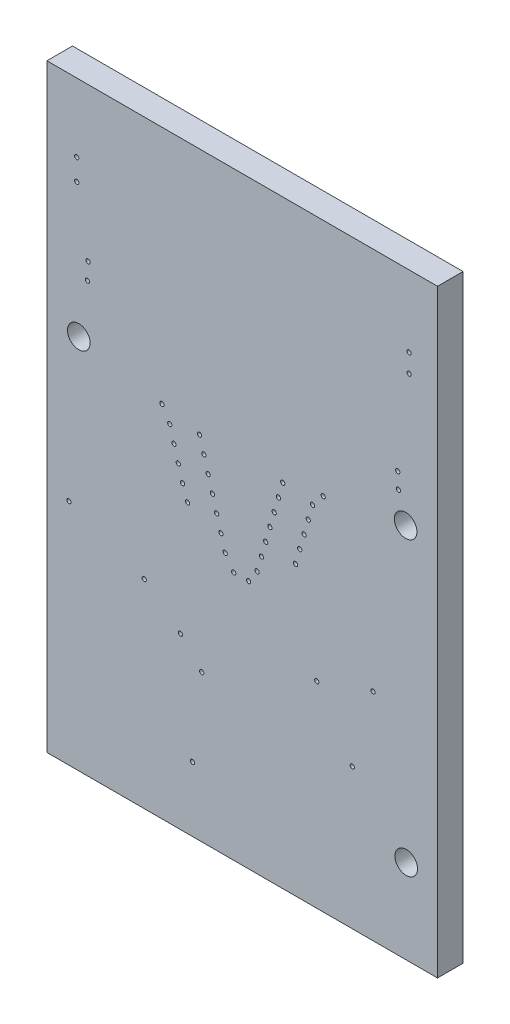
ISO-10303-21;
HEADER;
FILE_DESCRIPTION(('STEP AP214'),'2;1');
FILE_NAME('part.step','',(''),(''),'','','');
FILE_SCHEMA(('AUTOMOTIVE_DESIGN { 1 0 10303 214 1 1 1 1 }'));
ENDSEC;
DATA;
#1=APPLICATION_CONTEXT('core data for automotive mechanical design processes');
#2=APPLICATION_PROTOCOL_DEFINITION('international standard','automotive_design',2000,#1);
#3=PRODUCT_CONTEXT('',#1,'mechanical');
#4=PRODUCT('Part','Part','',(#3));
#5=PRODUCT_RELATED_PRODUCT_CATEGORY('part','',(#4));
#6=PRODUCT_DEFINITION_FORMATION('','',#4);
#7=PRODUCT_DEFINITION_CONTEXT('part definition',#1,'design');
#8=PRODUCT_DEFINITION('design','',#6,#7);
#9=PRODUCT_DEFINITION_SHAPE('','',#8);
#10=(LENGTH_UNIT() NAMED_UNIT(*) SI_UNIT(.MILLI.,.METRE.));
#11=(NAMED_UNIT(*) PLANE_ANGLE_UNIT() SI_UNIT($,.RADIAN.));
#12=(NAMED_UNIT(*) SI_UNIT($,.STERADIAN.) SOLID_ANGLE_UNIT());
#13=UNCERTAINTY_MEASURE_WITH_UNIT(LENGTH_MEASURE(1.E-05),#10,'distance_accuracy_value','');
#14=(GEOMETRIC_REPRESENTATION_CONTEXT(3) GLOBAL_UNCERTAINTY_ASSIGNED_CONTEXT((#13)) GLOBAL_UNIT_ASSIGNED_CONTEXT((#10,
#11,#12)) REPRESENTATION_CONTEXT('',''));
#15=CARTESIAN_POINT('',(0.,0.,0.));
#16=DIRECTION('',(0.,0.,1.));
#17=DIRECTION('',(1.,0.,0.));
#18=AXIS2_PLACEMENT_3D('',#15,#16,#17);
#19=CARTESIAN_POINT('',(13.97,0.,0.9144));
#20=DIRECTION('',(0.,1.,0.));
#21=DIRECTION('',(0.,0.,1.));
#22=AXIS2_PLACEMENT_3D('',#19,#20,#21);
#23=PLANE('',#22);
#24=DIRECTION('',(1.,0.,0.));
#25=VECTOR('',#24,1.);
#26=CARTESIAN_POINT('',(13.97,0.,0.));
#27=LINE('',#26,#25);
#28=CARTESIAN_POINT('',(0.,0.,0.));
#29=VERTEX_POINT('',#28);
#30=CARTESIAN_POINT('',(13.97,0.,0.));
#31=VERTEX_POINT('',#30);
#32=EDGE_CURVE('E101',#29,#31,#27,.T.);
#33=ORIENTED_EDGE('',*,*,#32,.T.);
#34=DIRECTION('',(0.,0.,-1.));
#35=VECTOR('',#34,1.);
#36=CARTESIAN_POINT('',(13.97,0.,0.9144));
#37=LINE('',#36,#35);
#38=CARTESIAN_POINT('',(13.97,0.,0.9144));
#39=VERTEX_POINT('',#38);
#40=EDGE_CURVE('E11',#39,#31,#37,.T.);
#41=ORIENTED_EDGE('',*,*,#40,.F.);
#42=DIRECTION('',(1.,0.,0.));
#43=VECTOR('',#42,1.);
#44=CARTESIAN_POINT('',(13.97,0.,0.9144));
#45=LINE('',#44,#43);
#46=CARTESIAN_POINT('',(0.,0.,0.9144));
#47=VERTEX_POINT('',#46);
#48=EDGE_CURVE('E89',#47,#39,#45,.T.);
#49=ORIENTED_EDGE('',*,*,#48,.F.);
#50=DIRECTION('',(0.,0.,-1.));
#51=VECTOR('',#50,1.);
#52=CARTESIAN_POINT('',(0.,0.,0.9144));
#53=LINE('',#52,#51);
#54=EDGE_CURVE('E97',#47,#29,#53,.T.);
#55=ORIENTED_EDGE('',*,*,#54,.T.);
#56=EDGE_LOOP('',(#33,#41,#49,#55));
#57=FACE_BOUND('',#56,.T.);
#58=ADVANCED_FACE('F38',(#57),#23,.F.);
#59=CARTESIAN_POINT('',(13.97,21.4249,0.9144));
#60=DIRECTION('',(-1.,0.,0.));
#61=DIRECTION('',(0.,0.,1.));
#62=AXIS2_PLACEMENT_3D('',#59,#60,#61);
#63=PLANE('',#62);
#64=DIRECTION('',(0.,1.,0.));
#65=VECTOR('',#64,1.);
#66=CARTESIAN_POINT('',(13.97,21.4249,0.));
#67=LINE('',#66,#65);
#68=CARTESIAN_POINT('',(13.97,21.4249,0.));
#69=VERTEX_POINT('',#68);
#70=EDGE_CURVE('E93',#31,#69,#67,.T.);
#71=ORIENTED_EDGE('',*,*,#70,.T.);
#72=DIRECTION('',(0.,0.,-1.));
#73=VECTOR('',#72,1.);
#74=CARTESIAN_POINT('',(13.97,21.4249,0.9144));
#75=LINE('',#74,#73);
#76=CARTESIAN_POINT('',(13.97,21.4249,0.9144));
#77=VERTEX_POINT('',#76);
#78=EDGE_CURVE('E46',#77,#69,#75,.T.);
#79=ORIENTED_EDGE('',*,*,#78,.F.);
#80=DIRECTION('',(0.,1.,0.));
#81=VECTOR('',#80,1.);
#82=CARTESIAN_POINT('',(13.97,21.4249,0.9144));
#83=LINE('',#82,#81);
#84=EDGE_CURVE('E84',#39,#77,#83,.T.);
#85=ORIENTED_EDGE('',*,*,#84,.F.);
#86=ORIENTED_EDGE('',*,*,#40,.T.);
#87=EDGE_LOOP('',(#71,#79,#85,#86));
#88=FACE_BOUND('',#87,.T.);
#89=ADVANCED_FACE('F92',(#88),#63,.F.);
#90=CARTESIAN_POINT('',(0.,21.4249,0.9144));
#91=DIRECTION('',(0.,-1.,0.));
#92=DIRECTION('',(0.,0.,-1.));
#93=AXIS2_PLACEMENT_3D('',#90,#91,#92);
#94=PLANE('',#93);
#95=DIRECTION('',(-1.,0.,0.));
#96=VECTOR('',#95,1.);
#97=CARTESIAN_POINT('',(0.,21.4249,0.));
#98=LINE('',#97,#96);
#99=CARTESIAN_POINT('',(0.,21.4249,0.));
#100=VERTEX_POINT('',#99);
#101=EDGE_CURVE('E71',#69,#100,#98,.T.);
#102=ORIENTED_EDGE('',*,*,#101,.T.);
#103=DIRECTION('',(0.,0.,-1.));
#104=VECTOR('',#103,1.);
#105=CARTESIAN_POINT('',(0.,21.4249,0.9144));
#106=LINE('',#105,#104);
#107=CARTESIAN_POINT('',(0.,21.4249,0.9144));
#108=VERTEX_POINT('',#107);
#109=EDGE_CURVE('E94',#108,#100,#106,.T.);
#110=ORIENTED_EDGE('',*,*,#109,.F.);
#111=DIRECTION('',(-1.,0.,0.));
#112=VECTOR('',#111,1.);
#113=CARTESIAN_POINT('',(0.,21.4249,0.9144));
#114=LINE('',#113,#112);
#115=EDGE_CURVE('E87',#77,#108,#114,.T.);
#116=ORIENTED_EDGE('',*,*,#115,.F.);
#117=ORIENTED_EDGE('',*,*,#78,.T.);
#118=EDGE_LOOP('',(#102,#110,#116,#117));
#119=FACE_BOUND('',#118,.T.);
#120=ADVANCED_FACE('F95',(#119),#94,.F.);
#121=CARTESIAN_POINT('',(0.,0.,0.9144));
#122=DIRECTION('',(1.,0.,0.));
#123=DIRECTION('',(0.,0.,-1.));
#124=AXIS2_PLACEMENT_3D('',#121,#122,#123);
#125=PLANE('',#124);
#126=DIRECTION('',(0.,-1.,0.));
#127=VECTOR('',#126,1.);
#128=CARTESIAN_POINT('',(0.,0.,0.));
#129=LINE('',#128,#127);
#130=EDGE_CURVE('E77',#100,#29,#129,.T.);
#131=ORIENTED_EDGE('',*,*,#130,.T.);
#132=ORIENTED_EDGE('',*,*,#54,.F.);
#133=DIRECTION('',(0.,-1.,0.));
#134=VECTOR('',#133,1.);
#135=CARTESIAN_POINT('',(0.,0.,0.9144));
#136=LINE('',#135,#134);
#137=EDGE_CURVE('E54',#108,#47,#136,.T.);
#138=ORIENTED_EDGE('',*,*,#137,.F.);
#139=ORIENTED_EDGE('',*,*,#109,.T.);
#140=EDGE_LOOP('',(#131,#132,#138,#139));
#141=FACE_BOUND('',#140,.T.);
#142=ADVANCED_FACE('F109',(#141),#125,.F.);
#143=CARTESIAN_POINT('',(0.,0.,0.9144));
#144=DIRECTION('',(0.,0.,-1.));
#145=DIRECTION('',(-1.,0.,0.));
#146=AXIS2_PLACEMENT_3D('',#143,#144,#145);
#147=PLANE('',#146);
#148=CARTESIAN_POINT('',(12.85,3.02,0.9144));
#149=DIRECTION('',(0.,0.,1.));
#150=DIRECTION('',(1.,0.,0.));
#151=AXIS2_PLACEMENT_3D('',#148,#149,#150);
#152=CIRCLE('',#151,0.405000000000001);
#153=CARTESIAN_POINT('',(13.255,3.02,0.9144));
#154=VERTEX_POINT('',#153);
#155=EDGE_CURVE('E389',#154,#154,#152,.T.);
#156=ORIENTED_EDGE('',*,*,#155,.F.);
#157=EDGE_LOOP('',(#156));
#158=FACE_BOUND('',#157,.T.);
#159=CARTESIAN_POINT('',(1.14,13.45,0.9144));
#160=DIRECTION('',(0.,0.,1.));
#161=DIRECTION('',(1.,0.,0.));
#162=AXIS2_PLACEMENT_3D('',#159,#160,#161);
#163=CIRCLE('',#162,0.405);
#164=CARTESIAN_POINT('',(1.545,13.45,0.9144));
#165=VERTEX_POINT('',#164);
#166=EDGE_CURVE('E383',#165,#165,#163,.T.);
#167=ORIENTED_EDGE('',*,*,#166,.F.);
#168=EDGE_LOOP('',(#167));
#169=FACE_BOUND('',#168,.T.);
#170=CARTESIAN_POINT('',(12.83,13.45,0.9144));
#171=DIRECTION('',(0.,0.,1.));
#172=DIRECTION('',(1.,0.,0.));
#173=AXIS2_PLACEMENT_3D('',#170,#171,#172);
#174=CIRCLE('',#173,0.405000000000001);
#175=CARTESIAN_POINT('',(13.235,13.45,0.9144));
#176=VERTEX_POINT('',#175);
#177=EDGE_CURVE('E377',#176,#176,#174,.T.);
#178=ORIENTED_EDGE('',*,*,#177,.F.);
#179=EDGE_LOOP('',(#178));
#180=FACE_BOUND('',#179,.T.);
#181=CARTESIAN_POINT('',(5.9182,10.9728,0.9144));
#182=DIRECTION('',(0.,0.,1.));
#183=DIRECTION('',(1.,0.,0.));
#184=AXIS2_PLACEMENT_3D('',#181,#182,#183);
#185=CIRCLE('',#184,0.0762000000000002);
#186=CARTESIAN_POINT('',(5.9944,10.9728,0.9144));
#187=VERTEX_POINT('',#186);
#188=EDGE_CURVE('E187',#187,#187,#185,.T.);
#189=ORIENTED_EDGE('',*,*,#188,.F.);
#190=EDGE_LOOP('',(#189));
#191=FACE_BOUND('',#190,.T.);
#192=CARTESIAN_POINT('',(6.0706,10.4394,0.9144));
#193=DIRECTION('',(0.,0.,1.));
#194=DIRECTION('',(1.,0.,0.));
#195=AXIS2_PLACEMENT_3D('',#192,#193,#194);
#196=CIRCLE('',#195,0.0762000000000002);
#197=CARTESIAN_POINT('',(6.1468,10.4394,0.9144));
#198=VERTEX_POINT('',#197);
#199=EDGE_CURVE('E257',#198,#198,#196,.T.);
#200=ORIENTED_EDGE('',*,*,#199,.F.);
#201=EDGE_LOOP('',(#200));
#202=FACE_BOUND('',#201,.T.);
#203=CARTESIAN_POINT('',(6.223,9.906,0.9144));
#204=DIRECTION('',(0.,0.,1.));
#205=DIRECTION('',(1.,0.,0.));
#206=AXIS2_PLACEMENT_3D('',#203,#204,#205);
#207=CIRCLE('',#206,0.0762000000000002);
#208=CARTESIAN_POINT('',(6.2992,9.906,0.9144));
#209=VERTEX_POINT('',#208);
#210=EDGE_CURVE('E251',#209,#209,#207,.T.);
#211=ORIENTED_EDGE('',*,*,#210,.F.);
#212=EDGE_LOOP('',(#211));
#213=FACE_BOUND('',#212,.T.);
#214=CARTESIAN_POINT('',(6.3754,9.3726,0.9144));
#215=DIRECTION('',(0.,0.,1.));
#216=DIRECTION('',(1.,0.,0.));
#217=AXIS2_PLACEMENT_3D('',#214,#215,#216);
#218=CIRCLE('',#217,0.0762000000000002);
#219=CARTESIAN_POINT('',(6.4516,9.3726,0.9144));
#220=VERTEX_POINT('',#219);
#221=EDGE_CURVE('E245',#220,#220,#218,.T.);
#222=ORIENTED_EDGE('',*,*,#221,.F.);
#223=EDGE_LOOP('',(#222));
#224=FACE_BOUND('',#223,.T.);
#225=CARTESIAN_POINT('',(9.8806,12.8778,0.9144));
#226=DIRECTION('',(0.,0.,1.));
#227=DIRECTION('',(1.,0.,0.));
#228=AXIS2_PLACEMENT_3D('',#225,#226,#227);
#229=CIRCLE('',#228,0.0762000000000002);
#230=CARTESIAN_POINT('',(9.9568,12.8778,0.9144));
#231=VERTEX_POINT('',#230);
#232=EDGE_CURVE('E234',#231,#231,#229,.T.);
#233=ORIENTED_EDGE('',*,*,#232,.F.);
#234=EDGE_LOOP('',(#233));
#235=FACE_BOUND('',#234,.T.);
#236=CARTESIAN_POINT('',(12.573,14.4272,0.9144));
#237=DIRECTION('',(0.,0.,1.));
#238=DIRECTION('',(1.,0.,0.));
#239=AXIS2_PLACEMENT_3D('',#236,#237,#238);
#240=CIRCLE('',#239,0.0762000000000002);
#241=CARTESIAN_POINT('',(12.6492,14.4272,0.9144));
#242=VERTEX_POINT('',#241);
#243=EDGE_CURVE('E221',#242,#242,#240,.T.);
#244=ORIENTED_EDGE('',*,*,#243,.F.);
#245=EDGE_LOOP('',(#244));
#246=FACE_BOUND('',#245,.T.);
#247=CARTESIAN_POINT('',(12.5476,14.986,0.9144));
#248=DIRECTION('',(0.,0.,1.));
#249=DIRECTION('',(1.,0.,0.));
#250=AXIS2_PLACEMENT_3D('',#247,#248,#249);
#251=CIRCLE('',#250,0.0762000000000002);
#252=CARTESIAN_POINT('',(12.6238,14.986,0.9144));
#253=VERTEX_POINT('',#252);
#254=EDGE_CURVE('E220',#253,#253,#251,.T.);
#255=ORIENTED_EDGE('',*,*,#254,.F.);
#256=EDGE_LOOP('',(#255));
#257=FACE_BOUND('',#256,.T.);
#258=CARTESIAN_POINT('',(6.6802,8.9154,0.9144));
#259=DIRECTION('',(0.,0.,1.));
#260=DIRECTION('',(1.,0.,0.));
#261=AXIS2_PLACEMENT_3D('',#258,#259,#260);
#262=CIRCLE('',#261,0.0762000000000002);
#263=CARTESIAN_POINT('',(6.7564,8.9154,0.9144));
#264=VERTEX_POINT('',#263);
#265=EDGE_CURVE('E227',#264,#264,#262,.T.);
#266=ORIENTED_EDGE('',*,*,#265,.F.);
#267=EDGE_LOOP('',(#266));
#268=FACE_BOUND('',#267,.T.);
#269=CARTESIAN_POINT('',(8.89,10.287,0.9144));
#270=DIRECTION('',(0.,0.,1.));
#271=DIRECTION('',(1.,0.,0.));
#272=AXIS2_PLACEMENT_3D('',#269,#270,#271);
#273=CIRCLE('',#272,0.0762000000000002);
#274=CARTESIAN_POINT('',(8.9662,10.287,0.9144));
#275=VERTEX_POINT('',#274);
#276=EDGE_CURVE('E269',#275,#275,#273,.T.);
#277=ORIENTED_EDGE('',*,*,#276,.F.);
#278=EDGE_LOOP('',(#277));
#279=FACE_BOUND('',#278,.T.);
#280=CARTESIAN_POINT('',(8.4328,12.573,0.9144));
#281=DIRECTION('',(0.,0.,1.));
#282=DIRECTION('',(1.,0.,0.));
#283=AXIS2_PLACEMENT_3D('',#280,#281,#282);
#284=CIRCLE('',#283,0.0762000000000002);
#285=CARTESIAN_POINT('',(8.509,12.573,0.9144));
#286=VERTEX_POINT('',#285);
#287=EDGE_CURVE('E293',#286,#286,#284,.T.);
#288=ORIENTED_EDGE('',*,*,#287,.F.);
#289=EDGE_LOOP('',(#288));
#290=FACE_BOUND('',#289,.T.);
#291=CARTESIAN_POINT('',(8.2804,12.0396,0.9144));
#292=DIRECTION('',(0.,0.,1.));
#293=DIRECTION('',(1.,0.,0.));
#294=AXIS2_PLACEMENT_3D('',#291,#292,#293);
#295=CIRCLE('',#294,0.0762000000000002);
#296=CARTESIAN_POINT('',(8.3566,12.0396,0.9144));
#297=VERTEX_POINT('',#296);
#298=EDGE_CURVE('E294',#297,#297,#295,.T.);
#299=ORIENTED_EDGE('',*,*,#298,.F.);
#300=EDGE_LOOP('',(#299));
#301=FACE_BOUND('',#300,.T.);
#302=CARTESIAN_POINT('',(8.128,11.5062,0.9144));
#303=DIRECTION('',(0.,0.,1.));
#304=DIRECTION('',(1.,0.,0.));
#305=AXIS2_PLACEMENT_3D('',#302,#303,#304);
#306=CIRCLE('',#305,0.0762000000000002);
#307=CARTESIAN_POINT('',(8.2042,11.5062,0.9144));
#308=VERTEX_POINT('',#307);
#309=EDGE_CURVE('E305',#308,#308,#306,.T.);
#310=ORIENTED_EDGE('',*,*,#309,.F.);
#311=EDGE_LOOP('',(#310));
#312=FACE_BOUND('',#311,.T.);
#313=CARTESIAN_POINT('',(9.0424,10.8204,0.9144));
#314=DIRECTION('',(0.,0.,1.));
#315=DIRECTION('',(1.,0.,0.));
#316=AXIS2_PLACEMENT_3D('',#313,#314,#315);
#317=CIRCLE('',#316,0.0762000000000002);
#318=CARTESIAN_POINT('',(9.1186,10.8204,0.9144));
#319=VERTEX_POINT('',#318);
#320=EDGE_CURVE('E268',#319,#319,#317,.T.);
#321=ORIENTED_EDGE('',*,*,#320,.F.);
#322=EDGE_LOOP('',(#321));
#323=FACE_BOUND('',#322,.T.);
#324=CARTESIAN_POINT('',(9.1948,11.3538,0.9144));
#325=DIRECTION('',(0.,0.,1.));
#326=DIRECTION('',(1.,0.,0.));
#327=AXIS2_PLACEMENT_3D('',#324,#325,#326);
#328=CIRCLE('',#327,0.0762000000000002);
#329=CARTESIAN_POINT('',(9.271,11.3538,0.9144));
#330=VERTEX_POINT('',#329);
#331=EDGE_CURVE('E276',#330,#330,#328,.T.);
#332=ORIENTED_EDGE('',*,*,#331,.F.);
#333=EDGE_LOOP('',(#332));
#334=FACE_BOUND('',#333,.T.);
#335=CARTESIAN_POINT('',(9.3472,11.8872,0.9144));
#336=DIRECTION('',(0.,0.,1.));
#337=DIRECTION('',(1.,0.,0.));
#338=AXIS2_PLACEMENT_3D('',#335,#336,#337);
#339=CIRCLE('',#338,0.0762000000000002);
#340=CARTESIAN_POINT('',(9.4234,11.8872,0.9144));
#341=VERTEX_POINT('',#340);
#342=EDGE_CURVE('E282',#341,#341,#339,.T.);
#343=ORIENTED_EDGE('',*,*,#342,.F.);
#344=EDGE_LOOP('',(#343));
#345=FACE_BOUND('',#344,.T.);
#346=CARTESIAN_POINT('',(9.4996,12.4206,0.9144));
#347=DIRECTION('',(0.,0.,1.));
#348=DIRECTION('',(1.,0.,0.));
#349=AXIS2_PLACEMENT_3D('',#346,#347,#348);
#350=CIRCLE('',#349,0.0762000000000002);
#351=CARTESIAN_POINT('',(9.5758,12.4206,0.9144));
#352=VERTEX_POINT('',#351);
#353=EDGE_CURVE('E235',#352,#352,#350,.T.);
#354=ORIENTED_EDGE('',*,*,#353,.F.);
#355=EDGE_LOOP('',(#354));
#356=FACE_BOUND('',#355,.T.);
#357=CARTESIAN_POINT('',(5.207,2.3114,0.9144));
#358=DIRECTION('',(0.,0.,1.));
#359=DIRECTION('',(1.,0.,0.));
#360=AXIS2_PLACEMENT_3D('',#357,#358,#359);
#361=CIRCLE('',#360,0.0762000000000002);
#362=CARTESIAN_POINT('',(5.2832,2.3114,0.9144));
#363=VERTEX_POINT('',#362);
#364=EDGE_CURVE('E125',#363,#363,#361,.T.);
#365=ORIENTED_EDGE('',*,*,#364,.F.);
#366=EDGE_LOOP('',(#365));
#367=FACE_BOUND('',#366,.T.);
#368=CARTESIAN_POINT('',(1.4732,15.9512,0.9144));
#369=DIRECTION('',(0.,0.,1.));
#370=DIRECTION('',(1.,0.,0.));
#371=AXIS2_PLACEMENT_3D('',#368,#369,#370);
#372=CIRCLE('',#371,0.0762);
#373=CARTESIAN_POINT('',(1.5494,15.9512,0.9144));
#374=VERTEX_POINT('',#373);
#375=EDGE_CURVE('E148',#374,#374,#372,.T.);
#376=ORIENTED_EDGE('',*,*,#375,.F.);
#377=EDGE_LOOP('',(#376));
#378=FACE_BOUND('',#377,.T.);
#379=CARTESIAN_POINT('',(1.4478,15.3416,0.9144));
#380=DIRECTION('',(0.,0.,1.));
#381=DIRECTION('',(1.,0.,0.));
#382=AXIS2_PLACEMENT_3D('',#379,#380,#381);
#383=CIRCLE('',#382,0.0762);
#384=CARTESIAN_POINT('',(1.524,15.3416,0.9144));
#385=VERTEX_POINT('',#384);
#386=EDGE_CURVE('E149',#385,#385,#383,.T.);
#387=ORIENTED_EDGE('',*,*,#386,.F.);
#388=EDGE_LOOP('',(#387));
#389=FACE_BOUND('',#388,.T.);
#390=CARTESIAN_POINT('',(4.1148,12.8524,0.9144));
#391=DIRECTION('',(0.,0.,1.));
#392=DIRECTION('',(1.,0.,0.));
#393=AXIS2_PLACEMENT_3D('',#390,#391,#392);
#394=CIRCLE('',#393,0.0762000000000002);
#395=CARTESIAN_POINT('',(4.191,12.8524,0.9144));
#396=VERTEX_POINT('',#395);
#397=EDGE_CURVE('E160',#396,#396,#394,.T.);
#398=ORIENTED_EDGE('',*,*,#397,.F.);
#399=EDGE_LOOP('',(#398));
#400=FACE_BOUND('',#399,.T.);
#401=CARTESIAN_POINT('',(0.7874,8.1788,0.9144));
#402=DIRECTION('',(0.,0.,1.));
#403=DIRECTION('',(1.,0.,0.));
#404=AXIS2_PLACEMENT_3D('',#401,#402,#403);
#405=CIRCLE('',#404,0.0762);
#406=CARTESIAN_POINT('',(0.8636,8.1788,0.9144));
#407=VERTEX_POINT('',#406);
#408=EDGE_CURVE('E124',#407,#407,#405,.T.);
#409=ORIENTED_EDGE('',*,*,#408,.F.);
#410=EDGE_LOOP('',(#409));
#411=FACE_BOUND('',#410,.T.);
#412=CARTESIAN_POINT('',(10.922,5.0292,0.9144));
#413=DIRECTION('',(0.,0.,1.));
#414=DIRECTION('',(1.,0.,0.));
#415=AXIS2_PLACEMENT_3D('',#412,#413,#414);
#416=CIRCLE('',#415,0.0762000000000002);
#417=CARTESIAN_POINT('',(10.9982,5.0292,0.9144));
#418=VERTEX_POINT('',#417);
#419=EDGE_CURVE('E131',#418,#418,#416,.T.);
#420=ORIENTED_EDGE('',*,*,#419,.F.);
#421=EDGE_LOOP('',(#420));
#422=FACE_BOUND('',#421,.T.);
#423=CARTESIAN_POINT('',(1.0668,18.9738,0.9144));
#424=DIRECTION('',(0.,0.,1.));
#425=DIRECTION('',(1.,0.,0.));
#426=AXIS2_PLACEMENT_3D('',#423,#424,#425);
#427=CIRCLE('',#426,0.0762);
#428=CARTESIAN_POINT('',(1.143,18.9738,0.9144));
#429=VERTEX_POINT('',#428);
#430=EDGE_CURVE('E137',#429,#429,#427,.T.);
#431=ORIENTED_EDGE('',*,*,#430,.F.);
#432=EDGE_LOOP('',(#431));
#433=FACE_BOUND('',#432,.T.);
#434=CARTESIAN_POINT('',(12.954,18.2118,0.9144));
#435=DIRECTION('',(0.,0.,1.));
#436=DIRECTION('',(1.,0.,0.));
#437=AXIS2_PLACEMENT_3D('',#434,#435,#436);
#438=CIRCLE('',#437,0.0762000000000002);
#439=CARTESIAN_POINT('',(13.0302,18.2118,0.9144));
#440=VERTEX_POINT('',#439);
#441=EDGE_CURVE('E118',#440,#440,#438,.T.);
#442=ORIENTED_EDGE('',*,*,#441,.F.);
#443=EDGE_LOOP('',(#442));
#444=FACE_BOUND('',#443,.T.);
#445=CARTESIAN_POINT('',(4.3942,12.3698,0.9144));
#446=DIRECTION('',(0.,0.,1.));
#447=DIRECTION('',(1.,0.,0.));
#448=AXIS2_PLACEMENT_3D('',#445,#446,#447);
#449=CIRCLE('',#448,0.0762000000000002);
#450=CARTESIAN_POINT('',(4.4704,12.3698,0.9144));
#451=VERTEX_POINT('',#450);
#452=EDGE_CURVE('E161',#451,#451,#449,.T.);
#453=ORIENTED_EDGE('',*,*,#452,.F.);
#454=EDGE_LOOP('',(#453));
#455=FACE_BOUND('',#454,.T.);
#456=CARTESIAN_POINT('',(4.5466,11.8364,0.9144));
#457=DIRECTION('',(0.,0.,1.));
#458=DIRECTION('',(1.,0.,0.));
#459=AXIS2_PLACEMENT_3D('',#456,#457,#458);
#460=CIRCLE('',#459,0.0762000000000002);
#461=CARTESIAN_POINT('',(4.6228,11.8364,0.9144));
#462=VERTEX_POINT('',#461);
#463=EDGE_CURVE('E209',#462,#462,#460,.T.);
#464=ORIENTED_EDGE('',*,*,#463,.F.);
#465=EDGE_LOOP('',(#464));
#466=FACE_BOUND('',#465,.T.);
#467=CARTESIAN_POINT('',(4.699,11.303,0.9144));
#468=DIRECTION('',(0.,0.,1.));
#469=DIRECTION('',(1.,0.,0.));
#470=AXIS2_PLACEMENT_3D('',#467,#468,#469);
#471=CIRCLE('',#470,0.0762000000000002);
#472=CARTESIAN_POINT('',(4.7752,11.303,0.9144));
#473=VERTEX_POINT('',#472);
#474=EDGE_CURVE('E203',#473,#473,#471,.T.);
#475=ORIENTED_EDGE('',*,*,#474,.F.);
#476=EDGE_LOOP('',(#475));
#477=FACE_BOUND('',#476,.T.);
#478=CARTESIAN_POINT('',(4.8514,10.7696,0.9144));
#479=DIRECTION('',(0.,0.,1.));
#480=DIRECTION('',(1.,0.,0.));
#481=AXIS2_PLACEMENT_3D('',#478,#479,#480);
#482=CIRCLE('',#481,0.0762000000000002);
#483=CARTESIAN_POINT('',(4.9276,10.7696,0.9144));
#484=VERTEX_POINT('',#483);
#485=EDGE_CURVE('E197',#484,#484,#482,.T.);
#486=ORIENTED_EDGE('',*,*,#485,.F.);
#487=EDGE_LOOP('',(#486));
#488=FACE_BOUND('',#487,.T.);
#489=CARTESIAN_POINT('',(5.7658,11.5062,0.9144));
#490=DIRECTION('',(0.,0.,1.));
#491=DIRECTION('',(1.,0.,0.));
#492=AXIS2_PLACEMENT_3D('',#489,#490,#491);
#493=CIRCLE('',#492,0.0762000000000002);
#494=CARTESIAN_POINT('',(5.842,11.5062,0.9144));
#495=VERTEX_POINT('',#494);
#496=EDGE_CURVE('E186',#495,#495,#493,.T.);
#497=ORIENTED_EDGE('',*,*,#496,.F.);
#498=EDGE_LOOP('',(#497));
#499=FACE_BOUND('',#498,.T.);
#500=CARTESIAN_POINT('',(5.6134,12.0396,0.9144));
#501=DIRECTION('',(0.,0.,1.));
#502=DIRECTION('',(1.,0.,0.));
#503=AXIS2_PLACEMENT_3D('',#500,#501,#502);
#504=CIRCLE('',#503,0.0762000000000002);
#505=CARTESIAN_POINT('',(5.6896,12.0396,0.9144));
#506=VERTEX_POINT('',#505);
#507=EDGE_CURVE('E173',#506,#506,#504,.T.);
#508=ORIENTED_EDGE('',*,*,#507,.F.);
#509=EDGE_LOOP('',(#508));
#510=FACE_BOUND('',#509,.T.);
#511=CARTESIAN_POINT('',(5.461,12.573,0.9144));
#512=DIRECTION('',(0.,0.,1.));
#513=DIRECTION('',(1.,0.,0.));
#514=AXIS2_PLACEMENT_3D('',#511,#512,#513);
#515=CIRCLE('',#514,0.0762000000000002);
#516=CARTESIAN_POINT('',(5.5372,12.573,0.9144));
#517=VERTEX_POINT('',#516);
#518=EDGE_CURVE('E172',#517,#517,#515,.T.);
#519=ORIENTED_EDGE('',*,*,#518,.F.);
#520=EDGE_LOOP('',(#519));
#521=FACE_BOUND('',#520,.T.);
#522=CARTESIAN_POINT('',(5.0292,10.2616,0.9144));
#523=DIRECTION('',(0.,0.,1.));
#524=DIRECTION('',(1.,0.,0.));
#525=AXIS2_PLACEMENT_3D('',#522,#523,#524);
#526=CIRCLE('',#525,0.0762000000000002);
#527=CARTESIAN_POINT('',(5.1054,10.2616,0.9144));
#528=VERTEX_POINT('',#527);
#529=EDGE_CURVE('E179',#528,#528,#526,.T.);
#530=ORIENTED_EDGE('',*,*,#529,.F.);
#531=EDGE_LOOP('',(#530));
#532=FACE_BOUND('',#531,.T.);
#533=CARTESIAN_POINT('',(3.4798,7.112,0.9144));
#534=DIRECTION('',(0.,0.,1.));
#535=DIRECTION('',(1.,0.,0.));
#536=AXIS2_PLACEMENT_3D('',#533,#534,#535);
#537=CIRCLE('',#536,0.0762000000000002);
#538=CARTESIAN_POINT('',(3.556,7.112,0.9144));
#539=VERTEX_POINT('',#538);
#540=EDGE_CURVE('E354',#539,#539,#537,.T.);
#541=ORIENTED_EDGE('',*,*,#540,.F.);
#542=EDGE_LOOP('',(#541));
#543=FACE_BOUND('',#542,.T.);
#544=CARTESIAN_POINT('',(5.5372,5.2578,0.9144));
#545=DIRECTION('',(0.,0.,1.));
#546=DIRECTION('',(1.,0.,0.));
#547=AXIS2_PLACEMENT_3D('',#544,#545,#546);
#548=CIRCLE('',#547,0.0762000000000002);
#549=CARTESIAN_POINT('',(5.6134,5.2578,0.9144));
#550=VERTEX_POINT('',#549);
#551=EDGE_CURVE('E365',#550,#550,#548,.T.);
#552=ORIENTED_EDGE('',*,*,#551,.F.);
#553=EDGE_LOOP('',(#552));
#554=FACE_BOUND('',#553,.T.);
#555=CARTESIAN_POINT('',(4.7752,6.0706,0.9144));
#556=DIRECTION('',(0.,0.,1.));
#557=DIRECTION('',(1.,0.,0.));
#558=AXIS2_PLACEMENT_3D('',#555,#556,#557);
#559=CIRCLE('',#558,0.0762000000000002);
#560=CARTESIAN_POINT('',(4.8514,6.0706,0.9144));
#561=VERTEX_POINT('',#560);
#562=EDGE_CURVE('E366',#561,#561,#559,.T.);
#563=ORIENTED_EDGE('',*,*,#562,.F.);
#564=EDGE_LOOP('',(#563));
#565=FACE_BOUND('',#564,.T.);
#566=CARTESIAN_POINT('',(7.9756,10.9728,0.9144));
#567=DIRECTION('',(0.,0.,1.));
#568=DIRECTION('',(1.,0.,0.));
#569=AXIS2_PLACEMENT_3D('',#566,#567,#568);
#570=CIRCLE('',#569,0.0762000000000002);
#571=CARTESIAN_POINT('',(8.0518,10.9728,0.9144));
#572=VERTEX_POINT('',#571);
#573=EDGE_CURVE('E306',#572,#572,#570,.T.);
#574=ORIENTED_EDGE('',*,*,#573,.F.);
#575=EDGE_LOOP('',(#574));
#576=FACE_BOUND('',#575,.T.);
#577=CARTESIAN_POINT('',(7.8232,10.4394,0.9144));
#578=DIRECTION('',(0.,0.,1.));
#579=DIRECTION('',(1.,0.,0.));
#580=AXIS2_PLACEMENT_3D('',#577,#578,#579);
#581=CIRCLE('',#580,0.0762000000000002);
#582=CARTESIAN_POINT('',(7.8994,10.4394,0.9144));
#583=VERTEX_POINT('',#582);
#584=EDGE_CURVE('E330',#583,#583,#581,.T.);
#585=ORIENTED_EDGE('',*,*,#584,.F.);
#586=EDGE_LOOP('',(#585));
#587=FACE_BOUND('',#586,.T.);
#588=CARTESIAN_POINT('',(7.6708,9.906,0.9144));
#589=DIRECTION('',(0.,0.,1.));
#590=DIRECTION('',(1.,0.,0.));
#591=AXIS2_PLACEMENT_3D('',#588,#589,#590);
#592=CIRCLE('',#591,0.0762000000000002);
#593=CARTESIAN_POINT('',(7.747,9.906,0.9144));
#594=VERTEX_POINT('',#593);
#595=EDGE_CURVE('E324',#594,#594,#592,.T.);
#596=ORIENTED_EDGE('',*,*,#595,.F.);
#597=EDGE_LOOP('',(#596));
#598=FACE_BOUND('',#597,.T.);
#599=CARTESIAN_POINT('',(7.5184,9.3726,0.9144));
#600=DIRECTION('',(0.,0.,1.));
#601=DIRECTION('',(1.,0.,0.));
#602=AXIS2_PLACEMENT_3D('',#599,#600,#601);
#603=CIRCLE('',#602,0.0762000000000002);
#604=CARTESIAN_POINT('',(7.5946,9.3726,0.9144));
#605=VERTEX_POINT('',#604);
#606=EDGE_CURVE('E317',#605,#605,#603,.T.);
#607=ORIENTED_EDGE('',*,*,#606,.F.);
#608=EDGE_LOOP('',(#607));
#609=FACE_BOUND('',#608,.T.);
#610=CARTESIAN_POINT('',(9.652,7.0358,0.9144));
#611=DIRECTION('',(0.,0.,1.));
#612=DIRECTION('',(1.,0.,0.));
#613=AXIS2_PLACEMENT_3D('',#610,#611,#612);
#614=CIRCLE('',#613,0.0762000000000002);
#615=CARTESIAN_POINT('',(9.7282,7.0358,0.9144));
#616=VERTEX_POINT('',#615);
#617=EDGE_CURVE('E353',#616,#616,#614,.T.);
#618=ORIENTED_EDGE('',*,*,#617,.F.);
#619=EDGE_LOOP('',(#618));
#620=FACE_BOUND('',#619,.T.);
#621=CARTESIAN_POINT('',(1.0668,18.2118,0.9144));
#622=DIRECTION('',(0.,0.,1.));
#623=DIRECTION('',(1.,0.,0.));
#624=AXIS2_PLACEMENT_3D('',#621,#622,#623);
#625=CIRCLE('',#624,0.0762);
#626=CARTESIAN_POINT('',(1.143,18.2118,0.9144));
#627=VERTEX_POINT('',#626);
#628=EDGE_CURVE('E342',#627,#627,#625,.T.);
#629=ORIENTED_EDGE('',*,*,#628,.F.);
#630=EDGE_LOOP('',(#629));
#631=FACE_BOUND('',#630,.T.);
#632=CARTESIAN_POINT('',(12.954,18.8722,0.9144));
#633=DIRECTION('',(0.,0.,1.));
#634=DIRECTION('',(1.,0.,0.));
#635=AXIS2_PLACEMENT_3D('',#632,#633,#634);
#636=CIRCLE('',#635,0.0762000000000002);
#637=CARTESIAN_POINT('',(13.0302,18.8722,0.9144));
#638=VERTEX_POINT('',#637);
#639=EDGE_CURVE('E341',#638,#638,#636,.T.);
#640=ORIENTED_EDGE('',*,*,#639,.F.);
#641=EDGE_LOOP('',(#640));
#642=FACE_BOUND('',#641,.T.);
#643=CARTESIAN_POINT('',(7.2136,8.9154,0.9144));
#644=DIRECTION('',(0.,0.,1.));
#645=DIRECTION('',(1.,0.,0.));
#646=AXIS2_PLACEMENT_3D('',#643,#644,#645);
#647=CIRCLE('',#646,0.0762000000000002);
#648=CARTESIAN_POINT('',(7.2898,8.9154,0.9144));
#649=VERTEX_POINT('',#648);
#650=EDGE_CURVE('E318',#649,#649,#647,.T.);
#651=ORIENTED_EDGE('',*,*,#650,.F.);
#652=EDGE_LOOP('',(#651));
#653=FACE_BOUND('',#652,.T.);
#654=CARTESIAN_POINT('',(11.6634,7.7216,0.9144));
#655=DIRECTION('',(0.,0.,1.));
#656=DIRECTION('',(1.,0.,0.));
#657=AXIS2_PLACEMENT_3D('',#654,#655,#656);
#658=CIRCLE('',#657,0.0762000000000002);
#659=CARTESIAN_POINT('',(11.7396,7.7216,0.9144));
#660=VERTEX_POINT('',#659);
#661=EDGE_CURVE('E104',#660,#660,#658,.T.);
#662=ORIENTED_EDGE('',*,*,#661,.F.);
#663=EDGE_LOOP('',(#662));
#664=FACE_BOUND('',#663,.T.);
#665=ORIENTED_EDGE('',*,*,#48,.T.);
#666=ORIENTED_EDGE('',*,*,#84,.T.);
#667=ORIENTED_EDGE('',*,*,#115,.T.);
#668=ORIENTED_EDGE('',*,*,#137,.T.);
#669=EDGE_LOOP('',(#665,#666,#667,#668));
#670=FACE_BOUND('',#669,.T.);
#671=ADVANCED_FACE('F85',(#158,#169,#180,#191,#202,#213,#224,#235,#246,#257,#268,#279,#290,#301,
#312,#323,#334,#345,#356,#367,#378,#389,#400,#411,#422,#433,#444,#455,#466,#477,#488,#499,#510,
#521,#532,#543,#554,#565,#576,#587,#598,#609,#620,#631,#642,#653,#664,#670),#147,.F.);
#672=CARTESIAN_POINT('',(0.,0.,0.));
#673=DIRECTION('',(0.,0.,-1.));
#674=DIRECTION('',(-1.,0.,0.));
#675=AXIS2_PLACEMENT_3D('',#672,#673,#674);
#676=PLANE('',#675);
#677=CARTESIAN_POINT('',(12.85,3.02,0.));
#678=DIRECTION('',(0.,0.,1.));
#679=DIRECTION('',(1.,0.,0.));
#680=AXIS2_PLACEMENT_3D('',#677,#678,#679);
#681=CIRCLE('',#680,0.405000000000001);
#682=CARTESIAN_POINT('',(13.255,3.02,0.));
#683=VERTEX_POINT('',#682);
#684=EDGE_CURVE('E386',#683,#683,#681,.T.);
#685=ORIENTED_EDGE('',*,*,#684,.T.);
#686=EDGE_LOOP('',(#685));
#687=FACE_BOUND('',#686,.T.);
#688=CARTESIAN_POINT('',(1.14,13.45,0.));
#689=DIRECTION('',(0.,0.,1.));
#690=DIRECTION('',(1.,0.,0.));
#691=AXIS2_PLACEMENT_3D('',#688,#689,#690);
#692=CIRCLE('',#691,0.405);
#693=CARTESIAN_POINT('',(1.545,13.45,0.));
#694=VERTEX_POINT('',#693);
#695=EDGE_CURVE('E392',#694,#694,#692,.T.);
#696=ORIENTED_EDGE('',*,*,#695,.T.);
#697=EDGE_LOOP('',(#696));
#698=FACE_BOUND('',#697,.T.);
#699=CARTESIAN_POINT('',(12.83,13.45,0.));
#700=DIRECTION('',(0.,0.,1.));
#701=DIRECTION('',(1.,0.,0.));
#702=AXIS2_PLACEMENT_3D('',#699,#700,#701);
#703=CIRCLE('',#702,0.405000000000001);
#704=CARTESIAN_POINT('',(13.235,13.45,0.));
#705=VERTEX_POINT('',#704);
#706=EDGE_CURVE('E380',#705,#705,#703,.T.);
#707=ORIENTED_EDGE('',*,*,#706,.T.);
#708=EDGE_LOOP('',(#707));
#709=FACE_BOUND('',#708,.T.);
#710=CARTESIAN_POINT('',(5.9182,10.9728,0.));
#711=DIRECTION('',(0.,0.,1.));
#712=DIRECTION('',(1.,0.,0.));
#713=AXIS2_PLACEMENT_3D('',#710,#711,#712);
#714=CIRCLE('',#713,0.0762000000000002);
#715=CARTESIAN_POINT('',(5.9944,10.9728,0.));
#716=VERTEX_POINT('',#715);
#717=EDGE_CURVE('E260',#716,#716,#714,.T.);
#718=ORIENTED_EDGE('',*,*,#717,.T.);
#719=EDGE_LOOP('',(#718));
#720=FACE_BOUND('',#719,.T.);
#721=CARTESIAN_POINT('',(6.0706,10.4394,0.));
#722=DIRECTION('',(0.,0.,1.));
#723=DIRECTION('',(1.,0.,0.));
#724=AXIS2_PLACEMENT_3D('',#721,#722,#723);
#725=CIRCLE('',#724,0.0762000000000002);
#726=CARTESIAN_POINT('',(6.1468,10.4394,0.));
#727=VERTEX_POINT('',#726);
#728=EDGE_CURVE('E254',#727,#727,#725,.T.);
#729=ORIENTED_EDGE('',*,*,#728,.T.);
#730=EDGE_LOOP('',(#729));
#731=FACE_BOUND('',#730,.T.);
#732=CARTESIAN_POINT('',(6.223,9.906,0.));
#733=DIRECTION('',(0.,0.,1.));
#734=DIRECTION('',(1.,0.,0.));
#735=AXIS2_PLACEMENT_3D('',#732,#733,#734);
#736=CIRCLE('',#735,0.0762000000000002);
#737=CARTESIAN_POINT('',(6.2992,9.906,0.));
#738=VERTEX_POINT('',#737);
#739=EDGE_CURVE('E248',#738,#738,#736,.T.);
#740=ORIENTED_EDGE('',*,*,#739,.T.);
#741=EDGE_LOOP('',(#740));
#742=FACE_BOUND('',#741,.T.);
#743=CARTESIAN_POINT('',(6.3754,9.3726,0.));
#744=DIRECTION('',(0.,0.,1.));
#745=DIRECTION('',(1.,0.,0.));
#746=AXIS2_PLACEMENT_3D('',#743,#744,#745);
#747=CIRCLE('',#746,0.0762000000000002);
#748=CARTESIAN_POINT('',(6.4516,9.3726,0.));
#749=VERTEX_POINT('',#748);
#750=EDGE_CURVE('E230',#749,#749,#747,.T.);
#751=ORIENTED_EDGE('',*,*,#750,.T.);
#752=EDGE_LOOP('',(#751));
#753=FACE_BOUND('',#752,.T.);
#754=CARTESIAN_POINT('',(9.8806,12.8778,0.));
#755=DIRECTION('',(0.,0.,1.));
#756=DIRECTION('',(1.,0.,0.));
#757=AXIS2_PLACEMENT_3D('',#754,#755,#756);
#758=CIRCLE('',#757,0.0762000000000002);
#759=CARTESIAN_POINT('',(9.9568,12.8778,0.));
#760=VERTEX_POINT('',#759);
#761=EDGE_CURVE('E231',#760,#760,#758,.T.);
#762=ORIENTED_EDGE('',*,*,#761,.T.);
#763=EDGE_LOOP('',(#762));
#764=FACE_BOUND('',#763,.T.);
#765=CARTESIAN_POINT('',(12.573,14.4272,0.));
#766=DIRECTION('',(0.,0.,1.));
#767=DIRECTION('',(1.,0.,0.));
#768=AXIS2_PLACEMENT_3D('',#765,#766,#767);
#769=CIRCLE('',#768,0.0762000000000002);
#770=CARTESIAN_POINT('',(12.6492,14.4272,0.));
#771=VERTEX_POINT('',#770);
#772=EDGE_CURVE('E238',#771,#771,#769,.T.);
#773=ORIENTED_EDGE('',*,*,#772,.T.);
#774=EDGE_LOOP('',(#773));
#775=FACE_BOUND('',#774,.T.);
#776=CARTESIAN_POINT('',(12.5476,14.986,0.));
#777=DIRECTION('',(0.,0.,1.));
#778=DIRECTION('',(1.,0.,0.));
#779=AXIS2_PLACEMENT_3D('',#776,#777,#778);
#780=CIRCLE('',#779,0.0762000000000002);
#781=CARTESIAN_POINT('',(12.6238,14.986,0.));
#782=VERTEX_POINT('',#781);
#783=EDGE_CURVE('E217',#782,#782,#780,.T.);
#784=ORIENTED_EDGE('',*,*,#783,.T.);
#785=EDGE_LOOP('',(#784));
#786=FACE_BOUND('',#785,.T.);
#787=CARTESIAN_POINT('',(6.6802,8.9154,0.));
#788=DIRECTION('',(0.,0.,1.));
#789=DIRECTION('',(1.,0.,0.));
#790=AXIS2_PLACEMENT_3D('',#787,#788,#789);
#791=CIRCLE('',#790,0.0762000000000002);
#792=CARTESIAN_POINT('',(6.7564,8.9154,0.));
#793=VERTEX_POINT('',#792);
#794=EDGE_CURVE('E224',#793,#793,#791,.T.);
#795=ORIENTED_EDGE('',*,*,#794,.T.);
#796=EDGE_LOOP('',(#795));
#797=FACE_BOUND('',#796,.T.);
#798=CARTESIAN_POINT('',(8.89,10.287,0.));
#799=DIRECTION('',(0.,0.,1.));
#800=DIRECTION('',(1.,0.,0.));
#801=AXIS2_PLACEMENT_3D('',#798,#799,#800);
#802=CIRCLE('',#801,0.0762000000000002);
#803=CARTESIAN_POINT('',(8.9662,10.287,0.));
#804=VERTEX_POINT('',#803);
#805=EDGE_CURVE('E297',#804,#804,#802,.T.);
#806=ORIENTED_EDGE('',*,*,#805,.T.);
#807=EDGE_LOOP('',(#806));
#808=FACE_BOUND('',#807,.T.);
#809=CARTESIAN_POINT('',(8.4328,12.573,0.));
#810=DIRECTION('',(0.,0.,1.));
#811=DIRECTION('',(1.,0.,0.));
#812=AXIS2_PLACEMENT_3D('',#809,#810,#811);
#813=CIRCLE('',#812,0.0762000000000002);
#814=CARTESIAN_POINT('',(8.509,12.573,0.));
#815=VERTEX_POINT('',#814);
#816=EDGE_CURVE('E290',#815,#815,#813,.T.);
#817=ORIENTED_EDGE('',*,*,#816,.T.);
#818=EDGE_LOOP('',(#817));
#819=FACE_BOUND('',#818,.T.);
#820=CARTESIAN_POINT('',(8.2804,12.0396,0.));
#821=DIRECTION('',(0.,0.,1.));
#822=DIRECTION('',(1.,0.,0.));
#823=AXIS2_PLACEMENT_3D('',#820,#821,#822);
#824=CIRCLE('',#823,0.0762000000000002);
#825=CARTESIAN_POINT('',(8.3566,12.0396,0.));
#826=VERTEX_POINT('',#825);
#827=EDGE_CURVE('E309',#826,#826,#824,.T.);
#828=ORIENTED_EDGE('',*,*,#827,.T.);
#829=EDGE_LOOP('',(#828));
#830=FACE_BOUND('',#829,.T.);
#831=CARTESIAN_POINT('',(8.128,11.5062,0.));
#832=DIRECTION('',(0.,0.,1.));
#833=DIRECTION('',(1.,0.,0.));
#834=AXIS2_PLACEMENT_3D('',#831,#832,#833);
#835=CIRCLE('',#834,0.0762000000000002);
#836=CARTESIAN_POINT('',(8.2042,11.5062,0.));
#837=VERTEX_POINT('',#836);
#838=EDGE_CURVE('E302',#837,#837,#835,.T.);
#839=ORIENTED_EDGE('',*,*,#838,.T.);
#840=EDGE_LOOP('',(#839));
#841=FACE_BOUND('',#840,.T.);
#842=CARTESIAN_POINT('',(9.0424,10.8204,0.));
#843=DIRECTION('',(0.,0.,1.));
#844=DIRECTION('',(1.,0.,0.));
#845=AXIS2_PLACEMENT_3D('',#842,#843,#844);
#846=CIRCLE('',#845,0.0762000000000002);
#847=CARTESIAN_POINT('',(9.1186,10.8204,0.));
#848=VERTEX_POINT('',#847);
#849=EDGE_CURVE('E265',#848,#848,#846,.T.);
#850=ORIENTED_EDGE('',*,*,#849,.T.);
#851=EDGE_LOOP('',(#850));
#852=FACE_BOUND('',#851,.T.);
#853=CARTESIAN_POINT('',(9.1948,11.3538,0.));
#854=DIRECTION('',(0.,0.,1.));
#855=DIRECTION('',(1.,0.,0.));
#856=AXIS2_PLACEMENT_3D('',#853,#854,#855);
#857=CIRCLE('',#856,0.0762000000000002);
#858=CARTESIAN_POINT('',(9.271,11.3538,0.));
#859=VERTEX_POINT('',#858);
#860=EDGE_CURVE('E272',#859,#859,#857,.T.);
#861=ORIENTED_EDGE('',*,*,#860,.T.);
#862=EDGE_LOOP('',(#861));
#863=FACE_BOUND('',#862,.T.);
#864=CARTESIAN_POINT('',(9.3472,11.8872,0.));
#865=DIRECTION('',(0.,0.,1.));
#866=DIRECTION('',(1.,0.,0.));
#867=AXIS2_PLACEMENT_3D('',#864,#865,#866);
#868=CIRCLE('',#867,0.0762000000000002);
#869=CARTESIAN_POINT('',(9.4234,11.8872,0.));
#870=VERTEX_POINT('',#869);
#871=EDGE_CURVE('E279',#870,#870,#868,.T.);
#872=ORIENTED_EDGE('',*,*,#871,.T.);
#873=EDGE_LOOP('',(#872));
#874=FACE_BOUND('',#873,.T.);
#875=CARTESIAN_POINT('',(9.4996,12.4206,0.));
#876=DIRECTION('',(0.,0.,1.));
#877=DIRECTION('',(1.,0.,0.));
#878=AXIS2_PLACEMENT_3D('',#875,#876,#877);
#879=CIRCLE('',#878,0.0762000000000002);
#880=CARTESIAN_POINT('',(9.5758,12.4206,0.));
#881=VERTEX_POINT('',#880);
#882=EDGE_CURVE('E285',#881,#881,#879,.T.);
#883=ORIENTED_EDGE('',*,*,#882,.T.);
#884=EDGE_LOOP('',(#883));
#885=FACE_BOUND('',#884,.T.);
#886=CARTESIAN_POINT('',(5.207,2.3114,0.));
#887=DIRECTION('',(0.,0.,1.));
#888=DIRECTION('',(1.,0.,0.));
#889=AXIS2_PLACEMENT_3D('',#886,#887,#888);
#890=CIRCLE('',#889,0.0762000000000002);
#891=CARTESIAN_POINT('',(5.2832,2.3114,0.));
#892=VERTEX_POINT('',#891);
#893=EDGE_CURVE('E152',#892,#892,#890,.T.);
#894=ORIENTED_EDGE('',*,*,#893,.T.);
#895=EDGE_LOOP('',(#894));
#896=FACE_BOUND('',#895,.T.);
#897=CARTESIAN_POINT('',(1.4732,15.9512,0.));
#898=DIRECTION('',(0.,0.,1.));
#899=DIRECTION('',(1.,0.,0.));
#900=AXIS2_PLACEMENT_3D('',#897,#898,#899);
#901=CIRCLE('',#900,0.0762);
#902=CARTESIAN_POINT('',(1.5494,15.9512,0.));
#903=VERTEX_POINT('',#902);
#904=EDGE_CURVE('E145',#903,#903,#901,.T.);
#905=ORIENTED_EDGE('',*,*,#904,.T.);
#906=EDGE_LOOP('',(#905));
#907=FACE_BOUND('',#906,.T.);
#908=CARTESIAN_POINT('',(1.4478,15.3416,0.));
#909=DIRECTION('',(0.,0.,1.));
#910=DIRECTION('',(1.,0.,0.));
#911=AXIS2_PLACEMENT_3D('',#908,#909,#910);
#912=CIRCLE('',#911,0.0762);
#913=CARTESIAN_POINT('',(1.524,15.3416,0.));
#914=VERTEX_POINT('',#913);
#915=EDGE_CURVE('E164',#914,#914,#912,.T.);
#916=ORIENTED_EDGE('',*,*,#915,.T.);
#917=EDGE_LOOP('',(#916));
#918=FACE_BOUND('',#917,.T.);
#919=CARTESIAN_POINT('',(4.1148,12.8524,0.));
#920=DIRECTION('',(0.,0.,1.));
#921=DIRECTION('',(1.,0.,0.));
#922=AXIS2_PLACEMENT_3D('',#919,#920,#921);
#923=CIRCLE('',#922,0.0762000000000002);
#924=CARTESIAN_POINT('',(4.191,12.8524,0.));
#925=VERTEX_POINT('',#924);
#926=EDGE_CURVE('E157',#925,#925,#923,.T.);
#927=ORIENTED_EDGE('',*,*,#926,.T.);
#928=EDGE_LOOP('',(#927));
#929=FACE_BOUND('',#928,.T.);
#930=CARTESIAN_POINT('',(0.7874,8.1788,0.));
#931=DIRECTION('',(0.,0.,1.));
#932=DIRECTION('',(1.,0.,0.));
#933=AXIS2_PLACEMENT_3D('',#930,#931,#932);
#934=CIRCLE('',#933,0.0762);
#935=CARTESIAN_POINT('',(0.8636,8.1788,0.));
#936=VERTEX_POINT('',#935);
#937=EDGE_CURVE('E121',#936,#936,#934,.T.);
#938=ORIENTED_EDGE('',*,*,#937,.T.);
#939=EDGE_LOOP('',(#938));
#940=FACE_BOUND('',#939,.T.);
#941=CARTESIAN_POINT('',(10.922,5.0292,0.));
#942=DIRECTION('',(0.,0.,1.));
#943=DIRECTION('',(1.,0.,0.));
#944=AXIS2_PLACEMENT_3D('',#941,#942,#943);
#945=CIRCLE('',#944,0.0762000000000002);
#946=CARTESIAN_POINT('',(10.9982,5.0292,0.));
#947=VERTEX_POINT('',#946);
#948=EDGE_CURVE('E128',#947,#947,#945,.T.);
#949=ORIENTED_EDGE('',*,*,#948,.T.);
#950=EDGE_LOOP('',(#949));
#951=FACE_BOUND('',#950,.T.);
#952=CARTESIAN_POINT('',(1.0668,18.9738,0.));
#953=DIRECTION('',(0.,0.,1.));
#954=DIRECTION('',(1.,0.,0.));
#955=AXIS2_PLACEMENT_3D('',#952,#953,#954);
#956=CIRCLE('',#955,0.0762);
#957=CARTESIAN_POINT('',(1.143,18.9738,0.));
#958=VERTEX_POINT('',#957);
#959=EDGE_CURVE('E134',#958,#958,#956,.T.);
#960=ORIENTED_EDGE('',*,*,#959,.T.);
#961=EDGE_LOOP('',(#960));
#962=FACE_BOUND('',#961,.T.);
#963=CARTESIAN_POINT('',(12.954,18.2118,0.));
#964=DIRECTION('',(0.,0.,1.));
#965=DIRECTION('',(1.,0.,0.));
#966=AXIS2_PLACEMENT_3D('',#963,#964,#965);
#967=CIRCLE('',#966,0.0762000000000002);
#968=CARTESIAN_POINT('',(13.0302,18.2118,0.));
#969=VERTEX_POINT('',#968);
#970=EDGE_CURVE('E140',#969,#969,#967,.T.);
#971=ORIENTED_EDGE('',*,*,#970,.T.);
#972=EDGE_LOOP('',(#971));
#973=FACE_BOUND('',#972,.T.);
#974=CARTESIAN_POINT('',(4.3942,12.3698,0.));
#975=DIRECTION('',(0.,0.,1.));
#976=DIRECTION('',(1.,0.,0.));
#977=AXIS2_PLACEMENT_3D('',#974,#975,#976);
#978=CIRCLE('',#977,0.0762000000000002);
#979=CARTESIAN_POINT('',(4.4704,12.3698,0.));
#980=VERTEX_POINT('',#979);
#981=EDGE_CURVE('E212',#980,#980,#978,.T.);
#982=ORIENTED_EDGE('',*,*,#981,.T.);
#983=EDGE_LOOP('',(#982));
#984=FACE_BOUND('',#983,.T.);
#985=CARTESIAN_POINT('',(4.5466,11.8364,0.));
#986=DIRECTION('',(0.,0.,1.));
#987=DIRECTION('',(1.,0.,0.));
#988=AXIS2_PLACEMENT_3D('',#985,#986,#987);
#989=CIRCLE('',#988,0.0762000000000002);
#990=CARTESIAN_POINT('',(4.6228,11.8364,0.));
#991=VERTEX_POINT('',#990);
#992=EDGE_CURVE('E206',#991,#991,#989,.T.);
#993=ORIENTED_EDGE('',*,*,#992,.T.);
#994=EDGE_LOOP('',(#993));
#995=FACE_BOUND('',#994,.T.);
#996=CARTESIAN_POINT('',(4.699,11.303,0.));
#997=DIRECTION('',(0.,0.,1.));
#998=DIRECTION('',(1.,0.,0.));
#999=AXIS2_PLACEMENT_3D('',#996,#997,#998);
#1000=CIRCLE('',#999,0.0762000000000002);
#1001=CARTESIAN_POINT('',(4.7752,11.303,0.));
#1002=VERTEX_POINT('',#1001);
#1003=EDGE_CURVE('E200',#1002,#1002,#1000,.T.);
#1004=ORIENTED_EDGE('',*,*,#1003,.T.);
#1005=EDGE_LOOP('',(#1004));
#1006=FACE_BOUND('',#1005,.T.);
#1007=CARTESIAN_POINT('',(4.8514,10.7696,0.));
#1008=DIRECTION('',(0.,0.,1.));
#1009=DIRECTION('',(1.,0.,0.));
#1010=AXIS2_PLACEMENT_3D('',#1007,#1008,#1009);
#1011=CIRCLE('',#1010,0.0762000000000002);
#1012=CARTESIAN_POINT('',(4.9276,10.7696,0.));
#1013=VERTEX_POINT('',#1012);
#1014=EDGE_CURVE('E182',#1013,#1013,#1011,.T.);
#1015=ORIENTED_EDGE('',*,*,#1014,.T.);
#1016=EDGE_LOOP('',(#1015));
#1017=FACE_BOUND('',#1016,.T.);
#1018=CARTESIAN_POINT('',(5.7658,11.5062,0.));
#1019=DIRECTION('',(0.,0.,1.));
#1020=DIRECTION('',(1.,0.,0.));
#1021=AXIS2_PLACEMENT_3D('',#1018,#1019,#1020);
#1022=CIRCLE('',#1021,0.0762000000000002);
#1023=CARTESIAN_POINT('',(5.842,11.5062,0.));
#1024=VERTEX_POINT('',#1023);
#1025=EDGE_CURVE('E183',#1024,#1024,#1022,.T.);
#1026=ORIENTED_EDGE('',*,*,#1025,.T.);
#1027=EDGE_LOOP('',(#1026));
#1028=FACE_BOUND('',#1027,.T.);
#1029=CARTESIAN_POINT('',(5.6134,12.0396,0.));
#1030=DIRECTION('',(0.,0.,1.));
#1031=DIRECTION('',(1.,0.,0.));
#1032=AXIS2_PLACEMENT_3D('',#1029,#1030,#1031);
#1033=CIRCLE('',#1032,0.0762000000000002);
#1034=CARTESIAN_POINT('',(5.6896,12.0396,0.));
#1035=VERTEX_POINT('',#1034);
#1036=EDGE_CURVE('E190',#1035,#1035,#1033,.T.);
#1037=ORIENTED_EDGE('',*,*,#1036,.T.);
#1038=EDGE_LOOP('',(#1037));
#1039=FACE_BOUND('',#1038,.T.);
#1040=CARTESIAN_POINT('',(5.461,12.573,0.));
#1041=DIRECTION('',(0.,0.,1.));
#1042=DIRECTION('',(1.,0.,0.));
#1043=AXIS2_PLACEMENT_3D('',#1040,#1041,#1042);
#1044=CIRCLE('',#1043,0.0762000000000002);
#1045=CARTESIAN_POINT('',(5.5372,12.573,0.));
#1046=VERTEX_POINT('',#1045);
#1047=EDGE_CURVE('E169',#1046,#1046,#1044,.T.);
#1048=ORIENTED_EDGE('',*,*,#1047,.T.);
#1049=EDGE_LOOP('',(#1048));
#1050=FACE_BOUND('',#1049,.T.);
#1051=CARTESIAN_POINT('',(5.0292,10.2616,0.));
#1052=DIRECTION('',(0.,0.,1.));
#1053=DIRECTION('',(1.,0.,0.));
#1054=AXIS2_PLACEMENT_3D('',#1051,#1052,#1053);
#1055=CIRCLE('',#1054,0.0762000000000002);
#1056=CARTESIAN_POINT('',(5.1054,10.2616,0.));
#1057=VERTEX_POINT('',#1056);
#1058=EDGE_CURVE('E176',#1057,#1057,#1055,.T.);
#1059=ORIENTED_EDGE('',*,*,#1058,.T.);
#1060=EDGE_LOOP('',(#1059));
#1061=FACE_BOUND('',#1060,.T.);
#1062=CARTESIAN_POINT('',(3.4798,7.112,0.));
#1063=DIRECTION('',(0.,0.,1.));
#1064=DIRECTION('',(1.,0.,0.));
#1065=AXIS2_PLACEMENT_3D('',#1062,#1063,#1064);
#1066=CIRCLE('',#1065,0.0762000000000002);
#1067=CARTESIAN_POINT('',(3.556,7.112,0.));
#1068=VERTEX_POINT('',#1067);
#1069=EDGE_CURVE('E369',#1068,#1068,#1066,.T.);
#1070=ORIENTED_EDGE('',*,*,#1069,.T.);
#1071=EDGE_LOOP('',(#1070));
#1072=FACE_BOUND('',#1071,.T.);
#1073=CARTESIAN_POINT('',(5.5372,5.2578,0.));
#1074=DIRECTION('',(0.,0.,1.));
#1075=DIRECTION('',(1.,0.,0.));
#1076=AXIS2_PLACEMENT_3D('',#1073,#1074,#1075);
#1077=CIRCLE('',#1076,0.0762000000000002);
#1078=CARTESIAN_POINT('',(5.6134,5.2578,0.));
#1079=VERTEX_POINT('',#1078);
#1080=EDGE_CURVE('E362',#1079,#1079,#1077,.T.);
#1081=ORIENTED_EDGE('',*,*,#1080,.T.);
#1082=EDGE_LOOP('',(#1081));
#1083=FACE_BOUND('',#1082,.T.);
#1084=CARTESIAN_POINT('',(4.7752,6.0706,0.));
#1085=DIRECTION('',(0.,0.,1.));
#1086=DIRECTION('',(1.,0.,0.));
#1087=AXIS2_PLACEMENT_3D('',#1084,#1085,#1086);
#1088=CIRCLE('',#1087,0.0762000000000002);
#1089=CARTESIAN_POINT('',(4.8514,6.0706,0.));
#1090=VERTEX_POINT('',#1089);
#1091=EDGE_CURVE('E374',#1090,#1090,#1088,.T.);
#1092=ORIENTED_EDGE('',*,*,#1091,.T.);
#1093=EDGE_LOOP('',(#1092));
#1094=FACE_BOUND('',#1093,.T.);
#1095=CARTESIAN_POINT('',(7.9756,10.9728,0.));
#1096=DIRECTION('',(0.,0.,1.));
#1097=DIRECTION('',(1.,0.,0.));
#1098=AXIS2_PLACEMENT_3D('',#1095,#1096,#1097);
#1099=CIRCLE('',#1098,0.0762000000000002);
#1100=CARTESIAN_POINT('',(8.0518,10.9728,0.));
#1101=VERTEX_POINT('',#1100);
#1102=EDGE_CURVE('E333',#1101,#1101,#1099,.T.);
#1103=ORIENTED_EDGE('',*,*,#1102,.T.);
#1104=EDGE_LOOP('',(#1103));
#1105=FACE_BOUND('',#1104,.T.);
#1106=CARTESIAN_POINT('',(7.8232,10.4394,0.));
#1107=DIRECTION('',(0.,0.,1.));
#1108=DIRECTION('',(1.,0.,0.));
#1109=AXIS2_PLACEMENT_3D('',#1106,#1107,#1108);
#1110=CIRCLE('',#1109,0.0762000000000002);
#1111=CARTESIAN_POINT('',(7.8994,10.4394,0.));
#1112=VERTEX_POINT('',#1111);
#1113=EDGE_CURVE('E327',#1112,#1112,#1110,.T.);
#1114=ORIENTED_EDGE('',*,*,#1113,.T.);
#1115=EDGE_LOOP('',(#1114));
#1116=FACE_BOUND('',#1115,.T.);
#1117=CARTESIAN_POINT('',(7.6708,9.906,0.));
#1118=DIRECTION('',(0.,0.,1.));
#1119=DIRECTION('',(1.,0.,0.));
#1120=AXIS2_PLACEMENT_3D('',#1117,#1118,#1119);
#1121=CIRCLE('',#1120,0.0762000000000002);
#1122=CARTESIAN_POINT('',(7.747,9.906,0.));
#1123=VERTEX_POINT('',#1122);
#1124=EDGE_CURVE('E321',#1123,#1123,#1121,.T.);
#1125=ORIENTED_EDGE('',*,*,#1124,.T.);
#1126=EDGE_LOOP('',(#1125));
#1127=FACE_BOUND('',#1126,.T.);
#1128=CARTESIAN_POINT('',(7.5184,9.3726,0.));
#1129=DIRECTION('',(0.,0.,1.));
#1130=DIRECTION('',(1.,0.,0.));
#1131=AXIS2_PLACEMENT_3D('',#1128,#1129,#1130);
#1132=CIRCLE('',#1131,0.0762000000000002);
#1133=CARTESIAN_POINT('',(7.5946,9.3726,0.));
#1134=VERTEX_POINT('',#1133);
#1135=EDGE_CURVE('E314',#1134,#1134,#1132,.T.);
#1136=ORIENTED_EDGE('',*,*,#1135,.T.);
#1137=EDGE_LOOP('',(#1136));
#1138=FACE_BOUND('',#1137,.T.);
#1139=CARTESIAN_POINT('',(9.652,7.0358,0.));
#1140=DIRECTION('',(0.,0.,1.));
#1141=DIRECTION('',(1.,0.,0.));
#1142=AXIS2_PLACEMENT_3D('',#1139,#1140,#1141);
#1143=CIRCLE('',#1142,0.0762000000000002);
#1144=CARTESIAN_POINT('',(9.7282,7.0358,0.));
#1145=VERTEX_POINT('',#1144);
#1146=EDGE_CURVE('E350',#1145,#1145,#1143,.T.);
#1147=ORIENTED_EDGE('',*,*,#1146,.T.);
#1148=EDGE_LOOP('',(#1147));
#1149=FACE_BOUND('',#1148,.T.);
#1150=CARTESIAN_POINT('',(1.0668,18.2118,0.));
#1151=DIRECTION('',(0.,0.,1.));
#1152=DIRECTION('',(1.,0.,0.));
#1153=AXIS2_PLACEMENT_3D('',#1150,#1151,#1152);
#1154=CIRCLE('',#1153,0.0762);
#1155=CARTESIAN_POINT('',(1.143,18.2118,0.));
#1156=VERTEX_POINT('',#1155);
#1157=EDGE_CURVE('E357',#1156,#1156,#1154,.T.);
#1158=ORIENTED_EDGE('',*,*,#1157,.T.);
#1159=EDGE_LOOP('',(#1158));
#1160=FACE_BOUND('',#1159,.T.);
#1161=CARTESIAN_POINT('',(12.954,18.8722,0.));
#1162=DIRECTION('',(0.,0.,1.));
#1163=DIRECTION('',(1.,0.,0.));
#1164=AXIS2_PLACEMENT_3D('',#1161,#1162,#1163);
#1165=CIRCLE('',#1164,0.0762000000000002);
#1166=CARTESIAN_POINT('',(13.0302,18.8722,0.));
#1167=VERTEX_POINT('',#1166);
#1168=EDGE_CURVE('E338',#1167,#1167,#1165,.T.);
#1169=ORIENTED_EDGE('',*,*,#1168,.T.);
#1170=EDGE_LOOP('',(#1169));
#1171=FACE_BOUND('',#1170,.T.);
#1172=CARTESIAN_POINT('',(7.2136,8.9154,0.));
#1173=DIRECTION('',(0.,0.,1.));
#1174=DIRECTION('',(1.,0.,0.));
#1175=AXIS2_PLACEMENT_3D('',#1172,#1173,#1174);
#1176=CIRCLE('',#1175,0.0762000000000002);
#1177=CARTESIAN_POINT('',(7.2898,8.9154,0.));
#1178=VERTEX_POINT('',#1177);
#1179=EDGE_CURVE('E345',#1178,#1178,#1176,.T.);
#1180=ORIENTED_EDGE('',*,*,#1179,.T.);
#1181=EDGE_LOOP('',(#1180));
#1182=FACE_BOUND('',#1181,.T.);
#1183=CARTESIAN_POINT('',(11.6634,7.7216,0.));
#1184=DIRECTION('',(0.,0.,1.));
#1185=DIRECTION('',(1.,0.,0.));
#1186=AXIS2_PLACEMENT_3D('',#1183,#1184,#1185);
#1187=CIRCLE('',#1186,0.0762000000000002);
#1188=CARTESIAN_POINT('',(11.7396,7.7216,0.));
#1189=VERTEX_POINT('',#1188);
#1190=EDGE_CURVE('E115',#1189,#1189,#1187,.T.);
#1191=ORIENTED_EDGE('',*,*,#1190,.T.);
#1192=EDGE_LOOP('',(#1191));
#1193=FACE_BOUND('',#1192,.T.);
#1194=ORIENTED_EDGE('',*,*,#32,.F.);
#1195=ORIENTED_EDGE('',*,*,#130,.F.);
#1196=ORIENTED_EDGE('',*,*,#101,.F.);
#1197=ORIENTED_EDGE('',*,*,#70,.F.);
#1198=EDGE_LOOP('',(#1194,#1195,#1196,#1197));
#1199=FACE_BOUND('',#1198,.T.);
#1200=ADVANCED_FACE('F112',(#687,#698,#709,#720,#731,#742,#753,#764,#775,#786,#797,#808,#819,
#830,#841,#852,#863,#874,#885,#896,#907,#918,#929,#940,#951,#962,#973,#984,#995,#1006,#1017,
#1028,#1039,#1050,#1061,#1072,#1083,#1094,#1105,#1116,#1127,#1138,#1149,#1160,#1171,#1182,#1193,
#1199),#676,.T.);
#1201=CARTESIAN_POINT('',(11.6634,7.7216,0.9144));
#1202=DIRECTION('',(0.,0.,-1.));
#1203=DIRECTION('',(-1.,0.,0.));
#1204=AXIS2_PLACEMENT_3D('',#1201,#1202,#1203);
#1205=CYLINDRICAL_SURFACE('',#1204,0.0762000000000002);
#1206=ORIENTED_EDGE('',*,*,#661,.T.);
#1207=EDGE_LOOP('',(#1206));
#1208=FACE_BOUND('',#1207,.T.);
#1209=ORIENTED_EDGE('',*,*,#1190,.F.);
#1210=EDGE_LOOP('',(#1209));
#1211=FACE_BOUND('',#1210,.T.);
#1212=ADVANCED_FACE('F495',(#1208,#1211),#1205,.F.);
#1213=CARTESIAN_POINT('',(7.2136,8.9154,0.9144));
#1214=DIRECTION('',(0.,0.,-1.));
#1215=DIRECTION('',(-1.,0.,0.));
#1216=AXIS2_PLACEMENT_3D('',#1213,#1214,#1215);
#1217=CYLINDRICAL_SURFACE('',#1216,0.0762000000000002);
#1218=ORIENTED_EDGE('',*,*,#650,.T.);
#1219=EDGE_LOOP('',(#1218));
#1220=FACE_BOUND('',#1219,.T.);
#1221=ORIENTED_EDGE('',*,*,#1179,.F.);
#1222=EDGE_LOOP('',(#1221));
#1223=FACE_BOUND('',#1222,.T.);
#1224=ADVANCED_FACE('F498',(#1220,#1223),#1217,.F.);
#1225=CARTESIAN_POINT('',(12.954,18.8722,0.9144));
#1226=DIRECTION('',(0.,0.,-1.));
#1227=DIRECTION('',(-1.,0.,0.));
#1228=AXIS2_PLACEMENT_3D('',#1225,#1226,#1227);
#1229=CYLINDRICAL_SURFACE('',#1228,0.0762000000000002);
#1230=ORIENTED_EDGE('',*,*,#639,.T.);
#1231=EDGE_LOOP('',(#1230));
#1232=FACE_BOUND('',#1231,.T.);
#1233=ORIENTED_EDGE('',*,*,#1168,.F.);
#1234=EDGE_LOOP('',(#1233));
#1235=FACE_BOUND('',#1234,.T.);
#1236=ADVANCED_FACE('F591',(#1232,#1235),#1229,.F.);
#1237=CARTESIAN_POINT('',(1.0668,18.2118,0.9144));
#1238=DIRECTION('',(0.,0.,-1.));
#1239=DIRECTION('',(-1.,0.,0.));
#1240=AXIS2_PLACEMENT_3D('',#1237,#1238,#1239);
#1241=CYLINDRICAL_SURFACE('',#1240,0.0762);
#1242=ORIENTED_EDGE('',*,*,#628,.T.);
#1243=EDGE_LOOP('',(#1242));
#1244=FACE_BOUND('',#1243,.T.);
#1245=ORIENTED_EDGE('',*,*,#1157,.F.);
#1246=EDGE_LOOP('',(#1245));
#1247=FACE_BOUND('',#1246,.T.);
#1248=ADVANCED_FACE('F587',(#1244,#1247),#1241,.F.);
#1249=CARTESIAN_POINT('',(9.652,7.0358,0.9144));
#1250=DIRECTION('',(0.,0.,-1.));
#1251=DIRECTION('',(-1.,0.,0.));
#1252=AXIS2_PLACEMENT_3D('',#1249,#1250,#1251);
#1253=CYLINDRICAL_SURFACE('',#1252,0.0762000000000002);
#1254=ORIENTED_EDGE('',*,*,#617,.T.);
#1255=EDGE_LOOP('',(#1254));
#1256=FACE_BOUND('',#1255,.T.);
#1257=ORIENTED_EDGE('',*,*,#1146,.F.);
#1258=EDGE_LOOP('',(#1257));
#1259=FACE_BOUND('',#1258,.T.);
#1260=ADVANCED_FACE('F590',(#1256,#1259),#1253,.F.);
#1261=CARTESIAN_POINT('',(7.5184,9.3726,0.9144));
#1262=DIRECTION('',(0.,0.,-1.));
#1263=DIRECTION('',(-1.,0.,0.));
#1264=AXIS2_PLACEMENT_3D('',#1261,#1262,#1263);
#1265=CYLINDRICAL_SURFACE('',#1264,0.0762000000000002);
#1266=ORIENTED_EDGE('',*,*,#606,.T.);
#1267=EDGE_LOOP('',(#1266));
#1268=FACE_BOUND('',#1267,.T.);
#1269=ORIENTED_EDGE('',*,*,#1135,.F.);
#1270=EDGE_LOOP('',(#1269));
#1271=FACE_BOUND('',#1270,.T.);
#1272=ADVANCED_FACE('F595',(#1268,#1271),#1265,.F.);
#1273=CARTESIAN_POINT('',(7.6708,9.906,0.9144));
#1274=DIRECTION('',(0.,0.,-1.));
#1275=DIRECTION('',(-1.,0.,0.));
#1276=AXIS2_PLACEMENT_3D('',#1273,#1274,#1275);
#1277=CYLINDRICAL_SURFACE('',#1276,0.0762000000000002);
#1278=ORIENTED_EDGE('',*,*,#595,.T.);
#1279=EDGE_LOOP('',(#1278));
#1280=FACE_BOUND('',#1279,.T.);
#1281=ORIENTED_EDGE('',*,*,#1124,.F.);
#1282=EDGE_LOOP('',(#1281));
#1283=FACE_BOUND('',#1282,.T.);
#1284=ADVANCED_FACE('F609',(#1280,#1283),#1277,.F.);
#1285=CARTESIAN_POINT('',(7.8232,10.4394,0.9144));
#1286=DIRECTION('',(0.,0.,-1.));
#1287=DIRECTION('',(-1.,0.,0.));
#1288=AXIS2_PLACEMENT_3D('',#1285,#1286,#1287);
#1289=CYLINDRICAL_SURFACE('',#1288,0.0762000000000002);
#1290=ORIENTED_EDGE('',*,*,#584,.T.);
#1291=EDGE_LOOP('',(#1290));
#1292=FACE_BOUND('',#1291,.T.);
#1293=ORIENTED_EDGE('',*,*,#1113,.F.);
#1294=EDGE_LOOP('',(#1293));
#1295=FACE_BOUND('',#1294,.T.);
#1296=ADVANCED_FACE('F605',(#1292,#1295),#1289,.F.);
#1297=CARTESIAN_POINT('',(7.9756,10.9728,0.9144));
#1298=DIRECTION('',(0.,0.,-1.));
#1299=DIRECTION('',(-1.,0.,0.));
#1300=AXIS2_PLACEMENT_3D('',#1297,#1298,#1299);
#1301=CYLINDRICAL_SURFACE('',#1300,0.0762000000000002);
#1302=ORIENTED_EDGE('',*,*,#573,.T.);
#1303=EDGE_LOOP('',(#1302));
#1304=FACE_BOUND('',#1303,.T.);
#1305=ORIENTED_EDGE('',*,*,#1102,.F.);
#1306=EDGE_LOOP('',(#1305));
#1307=FACE_BOUND('',#1306,.T.);
#1308=ADVANCED_FACE('F577',(#1304,#1307),#1301,.F.);
#1309=CARTESIAN_POINT('',(4.7752,6.0706,0.9144));
#1310=DIRECTION('',(0.,0.,-1.));
#1311=DIRECTION('',(-1.,0.,0.));
#1312=AXIS2_PLACEMENT_3D('',#1309,#1310,#1311);
#1313=CYLINDRICAL_SURFACE('',#1312,0.0762000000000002);
#1314=ORIENTED_EDGE('',*,*,#562,.T.);
#1315=EDGE_LOOP('',(#1314));
#1316=FACE_BOUND('',#1315,.T.);
#1317=ORIENTED_EDGE('',*,*,#1091,.F.);
#1318=EDGE_LOOP('',(#1317));
#1319=FACE_BOUND('',#1318,.T.);
#1320=ADVANCED_FACE('F573',(#1316,#1319),#1313,.F.);
#1321=CARTESIAN_POINT('',(5.5372,5.2578,0.9144));
#1322=DIRECTION('',(0.,0.,-1.));
#1323=DIRECTION('',(-1.,0.,0.));
#1324=AXIS2_PLACEMENT_3D('',#1321,#1322,#1323);
#1325=CYLINDRICAL_SURFACE('',#1324,0.0762000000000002);
#1326=ORIENTED_EDGE('',*,*,#551,.T.);
#1327=EDGE_LOOP('',(#1326));
#1328=FACE_BOUND('',#1327,.T.);
#1329=ORIENTED_EDGE('',*,*,#1080,.F.);
#1330=EDGE_LOOP('',(#1329));
#1331=FACE_BOUND('',#1330,.T.);
#1332=ADVANCED_FACE('F576',(#1328,#1331),#1325,.F.);
#1333=CARTESIAN_POINT('',(3.4798,7.112,0.9144));
#1334=DIRECTION('',(0.,0.,-1.));
#1335=DIRECTION('',(-1.,0.,0.));
#1336=AXIS2_PLACEMENT_3D('',#1333,#1334,#1335);
#1337=CYLINDRICAL_SURFACE('',#1336,0.0762000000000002);
#1338=ORIENTED_EDGE('',*,*,#540,.T.);
#1339=EDGE_LOOP('',(#1338));
#1340=FACE_BOUND('',#1339,.T.);
#1341=ORIENTED_EDGE('',*,*,#1069,.F.);
#1342=EDGE_LOOP('',(#1341));
#1343=FACE_BOUND('',#1342,.T.);
#1344=ADVANCED_FACE('F579',(#1340,#1343),#1337,.F.);
#1345=CARTESIAN_POINT('',(5.0292,10.2616,0.9144));
#1346=DIRECTION('',(0.,0.,-1.));
#1347=DIRECTION('',(-1.,0.,0.));
#1348=AXIS2_PLACEMENT_3D('',#1345,#1346,#1347);
#1349=CYLINDRICAL_SURFACE('',#1348,0.0762000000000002);
#1350=ORIENTED_EDGE('',*,*,#529,.T.);
#1351=EDGE_LOOP('',(#1350));
#1352=FACE_BOUND('',#1351,.T.);
#1353=ORIENTED_EDGE('',*,*,#1058,.F.);
#1354=EDGE_LOOP('',(#1353));
#1355=FACE_BOUND('',#1354,.T.);
#1356=ADVANCED_FACE('F582',(#1352,#1355),#1349,.F.);
#1357=CARTESIAN_POINT('',(5.461,12.573,0.9144));
#1358=DIRECTION('',(0.,0.,-1.));
#1359=DIRECTION('',(-1.,0.,0.));
#1360=AXIS2_PLACEMENT_3D('',#1357,#1358,#1359);
#1361=CYLINDRICAL_SURFACE('',#1360,0.0762000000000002);
#1362=ORIENTED_EDGE('',*,*,#518,.T.);
#1363=EDGE_LOOP('',(#1362));
#1364=FACE_BOUND('',#1363,.T.);
#1365=ORIENTED_EDGE('',*,*,#1047,.F.);
#1366=EDGE_LOOP('',(#1365));
#1367=FACE_BOUND('',#1366,.T.);
#1368=ADVANCED_FACE('F701',(#1364,#1367),#1361,.F.);
#1369=CARTESIAN_POINT('',(5.6134,12.0396,0.9144));
#1370=DIRECTION('',(0.,0.,-1.));
#1371=DIRECTION('',(-1.,0.,0.));
#1372=AXIS2_PLACEMENT_3D('',#1369,#1370,#1371);
#1373=CYLINDRICAL_SURFACE('',#1372,0.0762000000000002);
#1374=ORIENTED_EDGE('',*,*,#507,.T.);
#1375=EDGE_LOOP('',(#1374));
#1376=FACE_BOUND('',#1375,.T.);
#1377=ORIENTED_EDGE('',*,*,#1036,.F.);
#1378=EDGE_LOOP('',(#1377));
#1379=FACE_BOUND('',#1378,.T.);
#1380=ADVANCED_FACE('F698',(#1376,#1379),#1373,.F.);
#1381=CARTESIAN_POINT('',(5.7658,11.5062,0.9144));
#1382=DIRECTION('',(0.,0.,-1.));
#1383=DIRECTION('',(-1.,0.,0.));
#1384=AXIS2_PLACEMENT_3D('',#1381,#1382,#1383);
#1385=CYLINDRICAL_SURFACE('',#1384,0.0762000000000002);
#1386=ORIENTED_EDGE('',*,*,#496,.T.);
#1387=EDGE_LOOP('',(#1386));
#1388=FACE_BOUND('',#1387,.T.);
#1389=ORIENTED_EDGE('',*,*,#1025,.F.);
#1390=EDGE_LOOP('',(#1389));
#1391=FACE_BOUND('',#1390,.T.);
#1392=ADVANCED_FACE('F696',(#1388,#1391),#1385,.F.);
#1393=CARTESIAN_POINT('',(4.8514,10.7696,0.9144));
#1394=DIRECTION('',(0.,0.,-1.));
#1395=DIRECTION('',(-1.,0.,0.));
#1396=AXIS2_PLACEMENT_3D('',#1393,#1394,#1395);
#1397=CYLINDRICAL_SURFACE('',#1396,0.0762000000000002);
#1398=ORIENTED_EDGE('',*,*,#485,.T.);
#1399=EDGE_LOOP('',(#1398));
#1400=FACE_BOUND('',#1399,.T.);
#1401=ORIENTED_EDGE('',*,*,#1014,.F.);
#1402=EDGE_LOOP('',(#1401));
#1403=FACE_BOUND('',#1402,.T.);
#1404=ADVANCED_FACE('F692',(#1400,#1403),#1397,.F.);
#1405=CARTESIAN_POINT('',(4.699,11.303,0.9144));
#1406=DIRECTION('',(0.,0.,-1.));
#1407=DIRECTION('',(-1.,0.,0.));
#1408=AXIS2_PLACEMENT_3D('',#1405,#1406,#1407);
#1409=CYLINDRICAL_SURFACE('',#1408,0.0762000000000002);
#1410=ORIENTED_EDGE('',*,*,#474,.T.);
#1411=EDGE_LOOP('',(#1410));
#1412=FACE_BOUND('',#1411,.T.);
#1413=ORIENTED_EDGE('',*,*,#1003,.F.);
#1414=EDGE_LOOP('',(#1413));
#1415=FACE_BOUND('',#1414,.T.);
#1416=ADVANCED_FACE('F688',(#1412,#1415),#1409,.F.);
#1417=CARTESIAN_POINT('',(4.5466,11.8364,0.9144));
#1418=DIRECTION('',(0.,0.,-1.));
#1419=DIRECTION('',(-1.,0.,0.));
#1420=AXIS2_PLACEMENT_3D('',#1417,#1418,#1419);
#1421=CYLINDRICAL_SURFACE('',#1420,0.0762000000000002);
#1422=ORIENTED_EDGE('',*,*,#463,.T.);
#1423=EDGE_LOOP('',(#1422));
#1424=FACE_BOUND('',#1423,.T.);
#1425=ORIENTED_EDGE('',*,*,#992,.F.);
#1426=EDGE_LOOP('',(#1425));
#1427=FACE_BOUND('',#1426,.T.);
#1428=ADVANCED_FACE('F684',(#1424,#1427),#1421,.F.);
#1429=CARTESIAN_POINT('',(4.3942,12.3698,0.9144));
#1430=DIRECTION('',(0.,0.,-1.));
#1431=DIRECTION('',(-1.,0.,0.));
#1432=AXIS2_PLACEMENT_3D('',#1429,#1430,#1431);
#1433=CYLINDRICAL_SURFACE('',#1432,0.0762000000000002);
#1434=ORIENTED_EDGE('',*,*,#452,.T.);
#1435=EDGE_LOOP('',(#1434));
#1436=FACE_BOUND('',#1435,.T.);
#1437=ORIENTED_EDGE('',*,*,#981,.F.);
#1438=EDGE_LOOP('',(#1437));
#1439=FACE_BOUND('',#1438,.T.);
#1440=ADVANCED_FACE('F680',(#1436,#1439),#1433,.F.);
#1441=CARTESIAN_POINT('',(12.954,18.2118,0.9144));
#1442=DIRECTION('',(0.,0.,-1.));
#1443=DIRECTION('',(-1.,0.,0.));
#1444=AXIS2_PLACEMENT_3D('',#1441,#1442,#1443);
#1445=CYLINDRICAL_SURFACE('',#1444,0.0762000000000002);
#1446=ORIENTED_EDGE('',*,*,#441,.T.);
#1447=EDGE_LOOP('',(#1446));
#1448=FACE_BOUND('',#1447,.T.);
#1449=ORIENTED_EDGE('',*,*,#970,.F.);
#1450=EDGE_LOOP('',(#1449));
#1451=FACE_BOUND('',#1450,.T.);
#1452=ADVANCED_FACE('F683',(#1448,#1451),#1445,.F.);
#1453=CARTESIAN_POINT('',(1.0668,18.9738,0.9144));
#1454=DIRECTION('',(0.,0.,-1.));
#1455=DIRECTION('',(-1.,0.,0.));
#1456=AXIS2_PLACEMENT_3D('',#1453,#1454,#1455);
#1457=CYLINDRICAL_SURFACE('',#1456,0.0762);
#1458=ORIENTED_EDGE('',*,*,#430,.T.);
#1459=EDGE_LOOP('',(#1458));
#1460=FACE_BOUND('',#1459,.T.);
#1461=ORIENTED_EDGE('',*,*,#959,.F.);
#1462=EDGE_LOOP('',(#1461));
#1463=FACE_BOUND('',#1462,.T.);
#1464=ADVANCED_FACE('F730',(#1460,#1463),#1457,.F.);
#1465=CARTESIAN_POINT('',(10.922,5.0292,0.9144));
#1466=DIRECTION('',(0.,0.,-1.));
#1467=DIRECTION('',(-1.,0.,0.));
#1468=AXIS2_PLACEMENT_3D('',#1465,#1466,#1467);
#1469=CYLINDRICAL_SURFACE('',#1468,0.0762000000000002);
#1470=ORIENTED_EDGE('',*,*,#419,.T.);
#1471=EDGE_LOOP('',(#1470));
#1472=FACE_BOUND('',#1471,.T.);
#1473=ORIENTED_EDGE('',*,*,#948,.F.);
#1474=EDGE_LOOP('',(#1473));
#1475=FACE_BOUND('',#1474,.T.);
#1476=ADVANCED_FACE('F734',(#1472,#1475),#1469,.F.);
#1477=CARTESIAN_POINT('',(0.7874,8.1788,0.9144));
#1478=DIRECTION('',(0.,0.,-1.));
#1479=DIRECTION('',(-1.,0.,0.));
#1480=AXIS2_PLACEMENT_3D('',#1477,#1478,#1479);
#1481=CYLINDRICAL_SURFACE('',#1480,0.0762);
#1482=ORIENTED_EDGE('',*,*,#408,.T.);
#1483=EDGE_LOOP('',(#1482));
#1484=FACE_BOUND('',#1483,.T.);
#1485=ORIENTED_EDGE('',*,*,#937,.F.);
#1486=EDGE_LOOP('',(#1485));
#1487=FACE_BOUND('',#1486,.T.);
#1488=ADVANCED_FACE('F720',(#1484,#1487),#1481,.F.);
#1489=CARTESIAN_POINT('',(4.1148,12.8524,0.9144));
#1490=DIRECTION('',(0.,0.,-1.));
#1491=DIRECTION('',(-1.,0.,0.));
#1492=AXIS2_PLACEMENT_3D('',#1489,#1490,#1491);
#1493=CYLINDRICAL_SURFACE('',#1492,0.0762000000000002);
#1494=ORIENTED_EDGE('',*,*,#397,.T.);
#1495=EDGE_LOOP('',(#1494));
#1496=FACE_BOUND('',#1495,.T.);
#1497=ORIENTED_EDGE('',*,*,#926,.F.);
#1498=EDGE_LOOP('',(#1497));
#1499=FACE_BOUND('',#1498,.T.);
#1500=ADVANCED_FACE('F716',(#1496,#1499),#1493,.F.);
#1501=CARTESIAN_POINT('',(1.4478,15.3416,0.9144));
#1502=DIRECTION('',(0.,0.,-1.));
#1503=DIRECTION('',(-1.,0.,0.));
#1504=AXIS2_PLACEMENT_3D('',#1501,#1502,#1503);
#1505=CYLINDRICAL_SURFACE('',#1504,0.0762);
#1506=ORIENTED_EDGE('',*,*,#386,.T.);
#1507=EDGE_LOOP('',(#1506));
#1508=FACE_BOUND('',#1507,.T.);
#1509=ORIENTED_EDGE('',*,*,#915,.F.);
#1510=EDGE_LOOP('',(#1509));
#1511=FACE_BOUND('',#1510,.T.);
#1512=ADVANCED_FACE('F712',(#1508,#1511),#1505,.F.);
#1513=CARTESIAN_POINT('',(1.4732,15.9512,0.9144));
#1514=DIRECTION('',(0.,0.,-1.));
#1515=DIRECTION('',(-1.,0.,0.));
#1516=AXIS2_PLACEMENT_3D('',#1513,#1514,#1515);
#1517=CYLINDRICAL_SURFACE('',#1516,0.0762);
#1518=ORIENTED_EDGE('',*,*,#375,.T.);
#1519=EDGE_LOOP('',(#1518));
#1520=FACE_BOUND('',#1519,.T.);
#1521=ORIENTED_EDGE('',*,*,#904,.F.);
#1522=EDGE_LOOP('',(#1521));
#1523=FACE_BOUND('',#1522,.T.);
#1524=ADVANCED_FACE('F715',(#1520,#1523),#1517,.F.);
#1525=CARTESIAN_POINT('',(5.207,2.3114,0.9144));
#1526=DIRECTION('',(0.,0.,-1.));
#1527=DIRECTION('',(-1.,0.,0.));
#1528=AXIS2_PLACEMENT_3D('',#1525,#1526,#1527);
#1529=CYLINDRICAL_SURFACE('',#1528,0.0762000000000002);
#1530=ORIENTED_EDGE('',*,*,#364,.T.);
#1531=EDGE_LOOP('',(#1530));
#1532=FACE_BOUND('',#1531,.T.);
#1533=ORIENTED_EDGE('',*,*,#893,.F.);
#1534=EDGE_LOOP('',(#1533));
#1535=FACE_BOUND('',#1534,.T.);
#1536=ADVANCED_FACE('F639',(#1532,#1535),#1529,.F.);
#1537=CARTESIAN_POINT('',(9.4996,12.4206,0.9144));
#1538=DIRECTION('',(0.,0.,-1.));
#1539=DIRECTION('',(-1.,0.,0.));
#1540=AXIS2_PLACEMENT_3D('',#1537,#1538,#1539);
#1541=CYLINDRICAL_SURFACE('',#1540,0.0762000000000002);
#1542=ORIENTED_EDGE('',*,*,#353,.T.);
#1543=EDGE_LOOP('',(#1542));
#1544=FACE_BOUND('',#1543,.T.);
#1545=ORIENTED_EDGE('',*,*,#882,.F.);
#1546=EDGE_LOOP('',(#1545));
#1547=FACE_BOUND('',#1546,.T.);
#1548=ADVANCED_FACE('F635',(#1544,#1547),#1541,.F.);
#1549=CARTESIAN_POINT('',(9.3472,11.8872,0.9144));
#1550=DIRECTION('',(0.,0.,-1.));
#1551=DIRECTION('',(-1.,0.,0.));
#1552=AXIS2_PLACEMENT_3D('',#1549,#1550,#1551);
#1553=CYLINDRICAL_SURFACE('',#1552,0.0762000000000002);
#1554=ORIENTED_EDGE('',*,*,#342,.T.);
#1555=EDGE_LOOP('',(#1554));
#1556=FACE_BOUND('',#1555,.T.);
#1557=ORIENTED_EDGE('',*,*,#871,.F.);
#1558=EDGE_LOOP('',(#1557));
#1559=FACE_BOUND('',#1558,.T.);
#1560=ADVANCED_FACE('F638',(#1556,#1559),#1553,.F.);
#1561=CARTESIAN_POINT('',(9.1948,11.3538,0.9144));
#1562=DIRECTION('',(0.,0.,-1.));
#1563=DIRECTION('',(-1.,0.,0.));
#1564=AXIS2_PLACEMENT_3D('',#1561,#1562,#1563);
#1565=CYLINDRICAL_SURFACE('',#1564,0.0762000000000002);
#1566=ORIENTED_EDGE('',*,*,#331,.T.);
#1567=EDGE_LOOP('',(#1566));
#1568=FACE_BOUND('',#1567,.T.);
#1569=ORIENTED_EDGE('',*,*,#860,.F.);
#1570=EDGE_LOOP('',(#1569));
#1571=FACE_BOUND('',#1570,.T.);
#1572=ADVANCED_FACE('F643',(#1568,#1571),#1565,.F.);
#1573=CARTESIAN_POINT('',(9.0424,10.8204,0.9144));
#1574=DIRECTION('',(0.,0.,-1.));
#1575=DIRECTION('',(-1.,0.,0.));
#1576=AXIS2_PLACEMENT_3D('',#1573,#1574,#1575);
#1577=CYLINDRICAL_SURFACE('',#1576,0.0762000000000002);
#1578=ORIENTED_EDGE('',*,*,#320,.T.);
#1579=EDGE_LOOP('',(#1578));
#1580=FACE_BOUND('',#1579,.T.);
#1581=ORIENTED_EDGE('',*,*,#849,.F.);
#1582=EDGE_LOOP('',(#1581));
#1583=FACE_BOUND('',#1582,.T.);
#1584=ADVANCED_FACE('F625',(#1580,#1583),#1577,.F.);
#1585=CARTESIAN_POINT('',(8.128,11.5062,0.9144));
#1586=DIRECTION('',(0.,0.,-1.));
#1587=DIRECTION('',(-1.,0.,0.));
#1588=AXIS2_PLACEMENT_3D('',#1585,#1586,#1587);
#1589=CYLINDRICAL_SURFACE('',#1588,0.0762000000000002);
#1590=ORIENTED_EDGE('',*,*,#309,.T.);
#1591=EDGE_LOOP('',(#1590));
#1592=FACE_BOUND('',#1591,.T.);
#1593=ORIENTED_EDGE('',*,*,#838,.F.);
#1594=EDGE_LOOP('',(#1593));
#1595=FACE_BOUND('',#1594,.T.);
#1596=ADVANCED_FACE('F621',(#1592,#1595),#1589,.F.);
#1597=CARTESIAN_POINT('',(8.2804,12.0396,0.9144));
#1598=DIRECTION('',(0.,0.,-1.));
#1599=DIRECTION('',(-1.,0.,0.));
#1600=AXIS2_PLACEMENT_3D('',#1597,#1598,#1599);
#1601=CYLINDRICAL_SURFACE('',#1600,0.0762000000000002);
#1602=ORIENTED_EDGE('',*,*,#298,.T.);
#1603=EDGE_LOOP('',(#1602));
#1604=FACE_BOUND('',#1603,.T.);
#1605=ORIENTED_EDGE('',*,*,#827,.F.);
#1606=EDGE_LOOP('',(#1605));
#1607=FACE_BOUND('',#1606,.T.);
#1608=ADVANCED_FACE('F617',(#1604,#1607),#1601,.F.);
#1609=CARTESIAN_POINT('',(8.4328,12.573,0.9144));
#1610=DIRECTION('',(0.,0.,-1.));
#1611=DIRECTION('',(-1.,0.,0.));
#1612=AXIS2_PLACEMENT_3D('',#1609,#1610,#1611);
#1613=CYLINDRICAL_SURFACE('',#1612,0.0762000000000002);
#1614=ORIENTED_EDGE('',*,*,#287,.T.);
#1615=EDGE_LOOP('',(#1614));
#1616=FACE_BOUND('',#1615,.T.);
#1617=ORIENTED_EDGE('',*,*,#816,.F.);
#1618=EDGE_LOOP('',(#1617));
#1619=FACE_BOUND('',#1618,.T.);
#1620=ADVANCED_FACE('F620',(#1616,#1619),#1613,.F.);
#1621=CARTESIAN_POINT('',(8.89,10.287,0.9144));
#1622=DIRECTION('',(0.,0.,-1.));
#1623=DIRECTION('',(-1.,0.,0.));
#1624=AXIS2_PLACEMENT_3D('',#1621,#1622,#1623);
#1625=CYLINDRICAL_SURFACE('',#1624,0.0762000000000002);
#1626=ORIENTED_EDGE('',*,*,#276,.T.);
#1627=EDGE_LOOP('',(#1626));
#1628=FACE_BOUND('',#1627,.T.);
#1629=ORIENTED_EDGE('',*,*,#805,.F.);
#1630=EDGE_LOOP('',(#1629));
#1631=FACE_BOUND('',#1630,.T.);
#1632=ADVANCED_FACE('F627',(#1628,#1631),#1625,.F.);
#1633=CARTESIAN_POINT('',(6.6802,8.9154,0.9144));
#1634=DIRECTION('',(0.,0.,-1.));
#1635=DIRECTION('',(-1.,0.,0.));
#1636=AXIS2_PLACEMENT_3D('',#1633,#1634,#1635);
#1637=CYLINDRICAL_SURFACE('',#1636,0.0762000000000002);
#1638=ORIENTED_EDGE('',*,*,#265,.T.);
#1639=EDGE_LOOP('',(#1638));
#1640=FACE_BOUND('',#1639,.T.);
#1641=ORIENTED_EDGE('',*,*,#794,.F.);
#1642=EDGE_LOOP('',(#1641));
#1643=FACE_BOUND('',#1642,.T.);
#1644=ADVANCED_FACE('F630',(#1640,#1643),#1637,.F.);
#1645=CARTESIAN_POINT('',(12.5476,14.986,0.9144));
#1646=DIRECTION('',(0.,0.,-1.));
#1647=DIRECTION('',(-1.,0.,0.));
#1648=AXIS2_PLACEMENT_3D('',#1645,#1646,#1647);
#1649=CYLINDRICAL_SURFACE('',#1648,0.0762000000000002);
#1650=ORIENTED_EDGE('',*,*,#254,.T.);
#1651=EDGE_LOOP('',(#1650));
#1652=FACE_BOUND('',#1651,.T.);
#1653=ORIENTED_EDGE('',*,*,#783,.F.);
#1654=EDGE_LOOP('',(#1653));
#1655=FACE_BOUND('',#1654,.T.);
#1656=ADVANCED_FACE('F669',(#1652,#1655),#1649,.F.);
#1657=CARTESIAN_POINT('',(12.573,14.4272,0.9144));
#1658=DIRECTION('',(0.,0.,-1.));
#1659=DIRECTION('',(-1.,0.,0.));
#1660=AXIS2_PLACEMENT_3D('',#1657,#1658,#1659);
#1661=CYLINDRICAL_SURFACE('',#1660,0.0762000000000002);
#1662=ORIENTED_EDGE('',*,*,#243,.T.);
#1663=EDGE_LOOP('',(#1662));
#1664=FACE_BOUND('',#1663,.T.);
#1665=ORIENTED_EDGE('',*,*,#772,.F.);
#1666=EDGE_LOOP('',(#1665));
#1667=FACE_BOUND('',#1666,.T.);
#1668=ADVANCED_FACE('F666',(#1664,#1667),#1661,.F.);
#1669=CARTESIAN_POINT('',(9.8806,12.8778,0.9144));
#1670=DIRECTION('',(0.,0.,-1.));
#1671=DIRECTION('',(-1.,0.,0.));
#1672=AXIS2_PLACEMENT_3D('',#1669,#1670,#1671);
#1673=CYLINDRICAL_SURFACE('',#1672,0.0762000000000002);
#1674=ORIENTED_EDGE('',*,*,#232,.T.);
#1675=EDGE_LOOP('',(#1674));
#1676=FACE_BOUND('',#1675,.T.);
#1677=ORIENTED_EDGE('',*,*,#761,.F.);
#1678=EDGE_LOOP('',(#1677));
#1679=FACE_BOUND('',#1678,.T.);
#1680=ADVANCED_FACE('F664',(#1676,#1679),#1673,.F.);
#1681=CARTESIAN_POINT('',(6.3754,9.3726,0.9144));
#1682=DIRECTION('',(0.,0.,-1.));
#1683=DIRECTION('',(-1.,0.,0.));
#1684=AXIS2_PLACEMENT_3D('',#1681,#1682,#1683);
#1685=CYLINDRICAL_SURFACE('',#1684,0.0762000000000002);
#1686=ORIENTED_EDGE('',*,*,#221,.T.);
#1687=EDGE_LOOP('',(#1686));
#1688=FACE_BOUND('',#1687,.T.);
#1689=ORIENTED_EDGE('',*,*,#750,.F.);
#1690=EDGE_LOOP('',(#1689));
#1691=FACE_BOUND('',#1690,.T.);
#1692=ADVANCED_FACE('F660',(#1688,#1691),#1685,.F.);
#1693=CARTESIAN_POINT('',(6.223,9.906,0.9144));
#1694=DIRECTION('',(0.,0.,-1.));
#1695=DIRECTION('',(-1.,0.,0.));
#1696=AXIS2_PLACEMENT_3D('',#1693,#1694,#1695);
#1697=CYLINDRICAL_SURFACE('',#1696,0.0762000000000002);
#1698=ORIENTED_EDGE('',*,*,#210,.T.);
#1699=EDGE_LOOP('',(#1698));
#1700=FACE_BOUND('',#1699,.T.);
#1701=ORIENTED_EDGE('',*,*,#739,.F.);
#1702=EDGE_LOOP('',(#1701));
#1703=FACE_BOUND('',#1702,.T.);
#1704=ADVANCED_FACE('F656',(#1700,#1703),#1697,.F.);
#1705=CARTESIAN_POINT('',(6.0706,10.4394,0.9144));
#1706=DIRECTION('',(0.,0.,-1.));
#1707=DIRECTION('',(-1.,0.,0.));
#1708=AXIS2_PLACEMENT_3D('',#1705,#1706,#1707);
#1709=CYLINDRICAL_SURFACE('',#1708,0.0762000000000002);
#1710=ORIENTED_EDGE('',*,*,#199,.T.);
#1711=EDGE_LOOP('',(#1710));
#1712=FACE_BOUND('',#1711,.T.);
#1713=ORIENTED_EDGE('',*,*,#728,.F.);
#1714=EDGE_LOOP('',(#1713));
#1715=FACE_BOUND('',#1714,.T.);
#1716=ADVANCED_FACE('F652',(#1712,#1715),#1709,.F.);
#1717=CARTESIAN_POINT('',(5.9182,10.9728,0.9144));
#1718=DIRECTION('',(0.,0.,-1.));
#1719=DIRECTION('',(-1.,0.,0.));
#1720=AXIS2_PLACEMENT_3D('',#1717,#1718,#1719);
#1721=CYLINDRICAL_SURFACE('',#1720,0.0762000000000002);
#1722=ORIENTED_EDGE('',*,*,#188,.T.);
#1723=EDGE_LOOP('',(#1722));
#1724=FACE_BOUND('',#1723,.T.);
#1725=ORIENTED_EDGE('',*,*,#717,.F.);
#1726=EDGE_LOOP('',(#1725));
#1727=FACE_BOUND('',#1726,.T.);
#1728=ADVANCED_FACE('F533',(#1724,#1727),#1721,.F.);
#1729=CARTESIAN_POINT('',(12.83,13.45,0.9144));
#1730=DIRECTION('',(0.,0.,-1.));
#1731=DIRECTION('',(-1.,0.,0.));
#1732=AXIS2_PLACEMENT_3D('',#1729,#1730,#1731);
#1733=CYLINDRICAL_SURFACE('',#1732,0.405000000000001);
#1734=ORIENTED_EDGE('',*,*,#177,.T.);
#1735=EDGE_LOOP('',(#1734));
#1736=FACE_BOUND('',#1735,.T.);
#1737=ORIENTED_EDGE('',*,*,#706,.F.);
#1738=EDGE_LOOP('',(#1737));
#1739=FACE_BOUND('',#1738,.T.);
#1740=ADVANCED_FACE('F543',(#1736,#1739),#1733,.F.);
#1741=CARTESIAN_POINT('',(1.14,13.45,0.9144));
#1742=DIRECTION('',(0.,0.,-1.));
#1743=DIRECTION('',(-1.,0.,0.));
#1744=AXIS2_PLACEMENT_3D('',#1741,#1742,#1743);
#1745=CYLINDRICAL_SURFACE('',#1744,0.405);
#1746=ORIENTED_EDGE('',*,*,#166,.T.);
#1747=EDGE_LOOP('',(#1746));
#1748=FACE_BOUND('',#1747,.T.);
#1749=ORIENTED_EDGE('',*,*,#695,.F.);
#1750=EDGE_LOOP('',(#1749));
#1751=FACE_BOUND('',#1750,.T.);
#1752=ADVANCED_FACE('F398',(#1748,#1751),#1745,.F.);
#1753=CARTESIAN_POINT('',(12.85,3.02,0.9144));
#1754=DIRECTION('',(0.,0.,-1.));
#1755=DIRECTION('',(-1.,0.,0.));
#1756=AXIS2_PLACEMENT_3D('',#1753,#1754,#1755);
#1757=CYLINDRICAL_SURFACE('',#1756,0.405000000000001);
#1758=ORIENTED_EDGE('',*,*,#155,.T.);
#1759=EDGE_LOOP('',(#1758));
#1760=FACE_BOUND('',#1759,.T.);
#1761=ORIENTED_EDGE('',*,*,#684,.F.);
#1762=EDGE_LOOP('',(#1761));
#1763=FACE_BOUND('',#1762,.T.);
#1764=ADVANCED_FACE('F558',(#1760,#1763),#1757,.F.);
#1765=CLOSED_SHELL('',(#58,#89,#120,#142,#671,#1200,#1212,#1224,#1236,#1248,#1260,#1272,#1284,
#1296,#1308,#1320,#1332,#1344,#1356,#1368,#1380,#1392,#1404,#1416,#1428,#1440,#1452,#1464,#1476,
#1488,#1500,#1512,#1524,#1536,#1548,#1560,#1572,#1584,#1596,#1608,#1620,#1632,#1644,#1656,#1668,
#1680,#1692,#1704,#1716,#1728,#1740,#1752,#1764));
#1766=MANIFOLD_SOLID_BREP('B2',#1765);
#1767=ADVANCED_BREP_SHAPE_REPRESENTATION('',(#18,#1766),#14);
#1768=SHAPE_DEFINITION_REPRESENTATION(#9,#1767);
ENDSEC;
END-ISO-10303-21;
